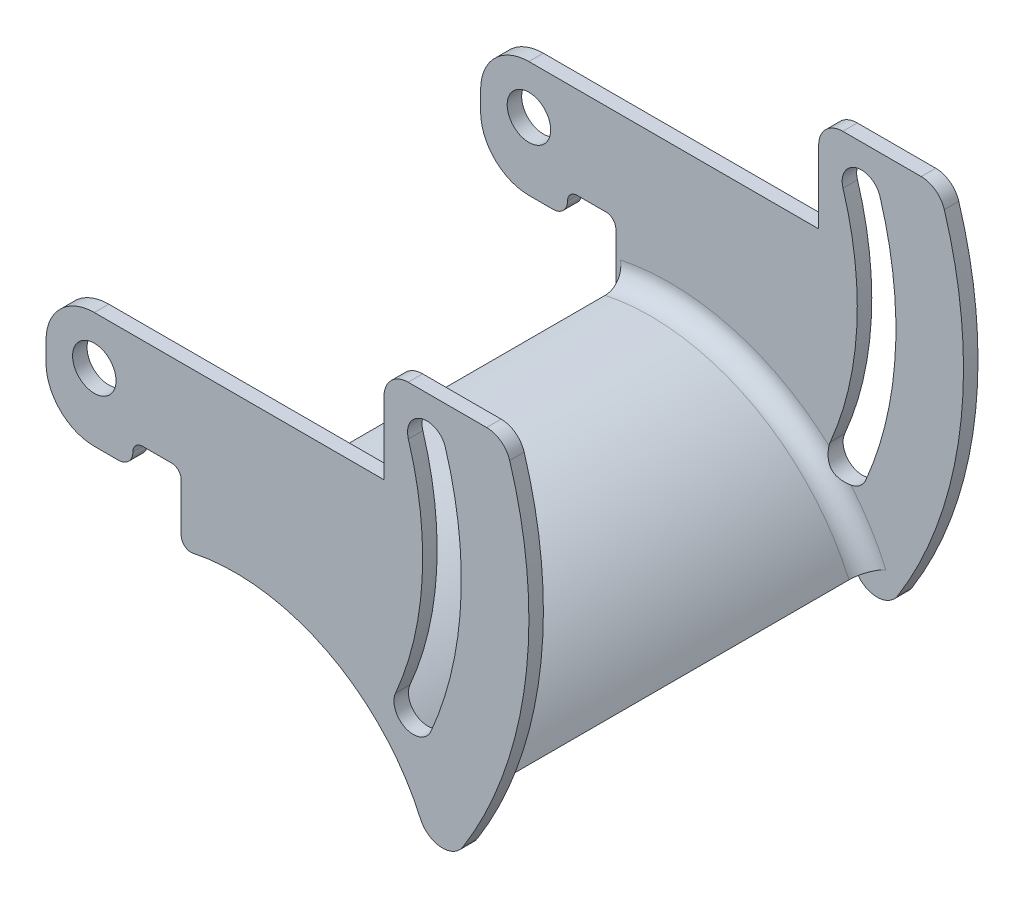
ISO-10303-21;
HEADER;
FILE_DESCRIPTION(('STEP AP214'),'2;1');
FILE_NAME('part.step','',(''),(''),'','','');
FILE_SCHEMA(('AUTOMOTIVE_DESIGN { 1 0 10303 214 1 1 1 1 }'));
ENDSEC;
DATA;
#1=APPLICATION_CONTEXT('core data for automotive mechanical design processes');
#2=APPLICATION_PROTOCOL_DEFINITION('international standard','automotive_design',2000,#1);
#3=PRODUCT_CONTEXT('',#1,'mechanical');
#4=PRODUCT('Part','Part','',(#3));
#5=PRODUCT_RELATED_PRODUCT_CATEGORY('part','',(#4));
#6=PRODUCT_DEFINITION_FORMATION('','',#4);
#7=PRODUCT_DEFINITION_CONTEXT('part definition',#1,'design');
#8=PRODUCT_DEFINITION('design','',#6,#7);
#9=PRODUCT_DEFINITION_SHAPE('','',#8);
#10=(LENGTH_UNIT() NAMED_UNIT(*) SI_UNIT(.MILLI.,.METRE.));
#11=(NAMED_UNIT(*) PLANE_ANGLE_UNIT() SI_UNIT($,.RADIAN.));
#12=(NAMED_UNIT(*) SI_UNIT($,.STERADIAN.) SOLID_ANGLE_UNIT());
#13=UNCERTAINTY_MEASURE_WITH_UNIT(LENGTH_MEASURE(1.E-05),#10,'distance_accuracy_value','');
#14=(GEOMETRIC_REPRESENTATION_CONTEXT(3) GLOBAL_UNCERTAINTY_ASSIGNED_CONTEXT((#13)) GLOBAL_UNIT_ASSIGNED_CONTEXT((#10,
#11,#12)) REPRESENTATION_CONTEXT('',''));
#15=CARTESIAN_POINT('',(0.,0.,0.));
#16=DIRECTION('',(0.,0.,1.));
#17=DIRECTION('',(1.,0.,0.));
#18=AXIS2_PLACEMENT_3D('',#15,#16,#17);
#19=CARTESIAN_POINT('',(-55.7123995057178,-94.0401304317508,7.00000000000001));
#20=DIRECTION('',(0.,0.,1.));
#21=DIRECTION('',(1.,0.,0.));
#22=AXIS2_PLACEMENT_3D('',#19,#20,#21);
#23=TOROIDAL_SURFACE('',#22,49.,4.);
#24=CARTESIAN_POINT('',(-22.7099331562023,-57.8208370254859,3.));
#25=CARTESIAN_POINT('',(-22.7320868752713,-57.9262736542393,2.99998607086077));
#26=CARTESIAN_POINT('',(-22.7499284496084,-58.0325440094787,3.00323212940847));
#27=CARTESIAN_POINT('',(-22.7769635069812,-58.2457428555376,3.01515067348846));
#28=CARTESIAN_POINT('',(-22.7861685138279,-58.3526702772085,3.0238159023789));
#29=CARTESIAN_POINT('',(-22.7959411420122,-58.5659211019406,3.04543035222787));
#30=CARTESIAN_POINT('',(-22.7965521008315,-58.6722448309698,3.05835774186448));
#31=CARTESIAN_POINT('',(-22.7893652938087,-58.8841765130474,3.08738972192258));
#32=CARTESIAN_POINT('',(-22.7815647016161,-58.9897842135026,3.10349537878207));
#33=CARTESIAN_POINT('',(-22.745853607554,-59.303655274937,3.15474074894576));
#34=CARTESIAN_POINT('',(-22.7056832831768,-59.5101242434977,3.19294899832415));
#35=CARTESIAN_POINT('',(-22.5934019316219,-59.9147168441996,3.26879456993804));
#36=CARTESIAN_POINT('',(-22.5212334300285,-60.1128247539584,3.30643073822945));
#37=CARTESIAN_POINT('',(-22.386103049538,-60.4086643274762,3.35741537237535));
#38=CARTESIAN_POINT('',(-22.3340065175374,-60.5108926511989,3.3740029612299));
#39=CARTESIAN_POINT('',(-22.2209266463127,-60.7109419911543,3.40327901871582));
#40=CARTESIAN_POINT('',(-22.159943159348,-60.8087629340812,3.41596742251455));
#41=CARTESIAN_POINT('',(-22.0296032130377,-60.9989394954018,3.43641543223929));
#42=CARTESIAN_POINT('',(-21.9602627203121,-61.0913050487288,3.44418426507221));
#43=CARTESIAN_POINT('',(-21.8136856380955,-61.2698602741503,3.45418266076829));
#44=CARTESIAN_POINT('',(-21.7364502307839,-61.3560508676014,3.45641305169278));
#45=CARTESIAN_POINT('',(-21.5837771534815,-61.5122358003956,3.45521975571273));
#46=CARTESIAN_POINT('',(-21.5090858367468,-61.5829670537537,3.45239426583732));
#47=CARTESIAN_POINT('',(-21.3546506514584,-61.7183326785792,3.44241362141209));
#48=CARTESIAN_POINT('',(-21.2749070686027,-61.782967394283,3.43525871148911));
#49=CARTESIAN_POINT('',(-21.1109289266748,-61.9057658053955,3.41708140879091));
#50=CARTESIAN_POINT('',(-21.0266916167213,-61.9639254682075,3.40605662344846));
#51=CARTESIAN_POINT('',(-20.8543410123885,-62.0734458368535,3.38083247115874));
#52=CARTESIAN_POINT('',(-20.7662260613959,-62.1248035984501,3.36663173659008));
#53=CARTESIAN_POINT('',(-20.4985529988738,-62.2674418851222,3.32078584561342));
#54=CARTESIAN_POINT('',(-20.3140375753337,-62.3484992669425,3.2856875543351));
#55=CARTESIAN_POINT('',(-19.9351187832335,-62.4820321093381,3.21355008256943));
#56=CARTESIAN_POINT('',(-19.7407049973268,-62.5344767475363,3.17650885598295));
#57=CARTESIAN_POINT('',(-19.4310009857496,-62.5934163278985,3.12304657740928));
#58=CARTESIAN_POINT('',(-19.3178972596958,-62.6099746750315,3.10464137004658));
#59=CARTESIAN_POINT('',(-19.090227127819,-62.6333616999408,3.07111372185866));
#60=CARTESIAN_POINT('',(-18.9756614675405,-62.6401951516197,3.0559896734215));
#61=CARTESIAN_POINT('',(-18.746158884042,-62.6439535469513,3.03046329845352));
#62=CARTESIAN_POINT('',(-18.6312239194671,-62.6409063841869,3.02004777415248));
#63=CARTESIAN_POINT('',(-18.4016666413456,-62.6248621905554,3.00524546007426));
#64=CARTESIAN_POINT('',(-18.2870442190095,-62.6118692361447,3.0008562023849));
#65=CARTESIAN_POINT('',(-18.0899209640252,-62.58083769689,2.99956939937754));
#66=CARTESIAN_POINT('',(-18.0070629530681,-62.5650922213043,3.00097604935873));
#67=CARTESIAN_POINT('',(-17.8426992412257,-62.5284487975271,3.00812394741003));
#68=CARTESIAN_POINT('',(-17.7611931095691,-62.5075525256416,3.01386378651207));
#69=CARTESIAN_POINT('',(-17.599507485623,-62.4606371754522,3.03011041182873));
#70=CARTESIAN_POINT('',(-17.519341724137,-62.4345823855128,3.04065113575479));
#71=CARTESIAN_POINT('',(-17.3614662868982,-62.3777606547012,3.06677961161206));
#72=CARTESIAN_POINT('',(-17.2837587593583,-62.3469897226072,3.08237165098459));
#73=CARTESIAN_POINT('',(-17.2076110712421,-62.3140404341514,3.1006158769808));
#74=B_SPLINE_CURVE_WITH_KNOTS('',3,(#24,#25,#26,#27,#28,#29,#30,#31,#32,#33,#34,#35,#36,#37,#38,
#39,#40,#41,#42,#43,#44,#45,#46,#47,#48,#49,#50,#51,#52,#53,#54,#55,#56,#57,#58,#59,#60,#61,#62,
#63,#64,#65,#66,#67,#68,#69,#70,#71,#72,#73),.UNSPECIFIED.,.F.,.F.,(4,2,2,2,2,2,2,2,2,2,2,2,2,2,
2,2,2,2,2,2,2,2,2,2,4),(0.,0.3229759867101,0.645520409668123,0.966437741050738,1.28746293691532,
1.9260537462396,2.56579625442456,2.91317131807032,3.26055215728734,3.60727952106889,
3.95395504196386,4.26227891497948,4.57058536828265,4.87908277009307,5.18771327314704,
5.79892082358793,6.41078548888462,6.75773637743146,7.10451689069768,7.4503192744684,
7.79598000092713,8.04878292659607,8.30150368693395,8.55603935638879,8.81079163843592),.UNSPECIFIED.);
#75=CARTESIAN_POINT('',(-22.7099331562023,-57.8208370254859,3.));
#76=VERTEX_POINT('',#75);
#77=CARTESIAN_POINT('',(-18.1386608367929,-62.5883552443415,3.));
#78=VERTEX_POINT('',#77);
#79=EDGE_CURVE('E707',#76,#78,#74,.T.);
#80=ORIENTED_EDGE('',*,*,#79,.F.);
#81=CARTESIAN_POINT('',(-55.7123995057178,-94.0401304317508,3.));
#82=DIRECTION('',(0.,0.,1.));
#83=DIRECTION('',(1.,0.,0.));
#84=AXIS2_PLACEMENT_3D('',#81,#82,#83);
#85=CIRCLE('',#84,49.);
#86=CARTESIAN_POINT('',(-65.8914971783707,-46.109076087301,3.));
#87=VERTEX_POINT('',#86);
#88=EDGE_CURVE('E702',#87,#76,#85,.F.);
#89=ORIENTED_EDGE('',*,*,#88,.F.);
#90=CARTESIAN_POINT('',(-65.8914971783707,-46.109076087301,7.00000000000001));
#91=DIRECTION('',(-0.97818478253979,-0.207736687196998,0.));
#92=DIRECTION('',(0.207736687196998,-0.97818478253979,0.));
#93=AXIS2_PLACEMENT_3D('',#90,#91,#92);
#94=CIRCLE('',#93,4.);
#95=CARTESIAN_POINT('',(-65.0605504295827,-50.0218152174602,7.00000000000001));
#96=VERTEX_POINT('',#95);
#97=EDGE_CURVE('E11',#87,#96,#94,.T.);
#98=ORIENTED_EDGE('',*,*,#97,.T.);
#99=CARTESIAN_POINT('',(-55.7123995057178,-94.0401304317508,7.00000000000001));
#100=DIRECTION('',(0.,0.,1.));
#101=DIRECTION('',(1.,0.,0.));
#102=AXIS2_PLACEMENT_3D('',#99,#100,#101);
#103=CIRCLE('',#102,45.);
#104=CARTESIAN_POINT('',(-14.5703248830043,-75.8102183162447,7.00000000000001));
#105=VERTEX_POINT('',#104);
#106=EDGE_CURVE('E699',#105,#96,#103,.T.);
#107=ORIENTED_EDGE('',*,*,#106,.F.);
#108=CARTESIAN_POINT('',(-10.9132515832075,-74.1897816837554,7.00000000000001));
#109=DIRECTION('',(0.405109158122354,-0.91426832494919,0.));
#110=DIRECTION('',(0.91426832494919,0.405109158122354,0.));
#111=AXIS2_PLACEMENT_3D('',#108,#109,#110);
#112=CIRCLE('',#111,4.);
#113=CARTESIAN_POINT('',(-10.9132515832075,-74.1897816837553,3.));
#114=VERTEX_POINT('',#113);
#115=EDGE_CURVE('E42',#105,#114,#112,.T.);
#116=ORIENTED_EDGE('',*,*,#115,.T.);
#117=CARTESIAN_POINT('',(-55.7123995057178,-94.0401304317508,3.));
#118=DIRECTION('',(0.,0.,1.));
#119=DIRECTION('',(1.,0.,0.));
#120=AXIS2_PLACEMENT_3D('',#117,#118,#119);
#121=CIRCLE('',#120,49.);
#122=EDGE_CURVE('E704',#78,#114,#121,.F.);
#123=ORIENTED_EDGE('',*,*,#122,.F.);
#124=EDGE_LOOP('',(#80,#89,#98,#107,#116,#123));
#125=FACE_BOUND('',#124,.T.);
#126=ADVANCED_FACE('F34',(#125),#23,.F.);
#127=CARTESIAN_POINT('',(-84.8528137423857,-30.,3.));
#128=DIRECTION('',(0.,0.,1.));
#129=DIRECTION('',(1.,0.,0.));
#130=AXIS2_PLACEMENT_3D('',#127,#128,#129);
#131=PLANE('',#130);
#132=CARTESIAN_POINT('',(-84.8528137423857,-30.,3.));
#133=DIRECTION('',(0.,0.,1.));
#134=DIRECTION('',(1.,0.,0.));
#135=AXIS2_PLACEMENT_3D('',#132,#133,#134);
#136=CIRCLE('',#135,4.5);
#137=CARTESIAN_POINT('',(-80.3528137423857,-30.,3.));
#138=VERTEX_POINT('',#137);
#139=EDGE_CURVE('E568',#138,#138,#136,.T.);
#140=ORIENTED_EDGE('',*,*,#139,.F.);
#141=EDGE_LOOP('',(#140));
#142=FACE_BOUND('',#141,.T.);
#143=CARTESIAN_POINT('',(-18.7952576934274,-58.6426131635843,3.));
#144=DIRECTION('',(0.,0.,1.));
#145=DIRECTION('',(1.,0.,0.));
#146=AXIS2_PLACEMENT_3D('',#143,#144,#145);
#147=CIRCLE('',#146,4.);
#148=CARTESIAN_POINT('',(-15.1253934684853,-60.2338694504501,3.));
#149=VERTEX_POINT('',#148);
#150=EDGE_CURVE('E541',#78,#149,#147,.T.);
#151=ORIENTED_EDGE('',*,*,#150,.F.);
#152=ORIENTED_EDGE('',*,*,#122,.T.);
#153=DIRECTION('',(-0.91426832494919,-0.405109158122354,0.));
#154=VECTOR('',#153,1.);
#155=CARTESIAN_POINT('',(-14.5703248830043,-75.8102183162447,3.));
#156=LINE('',#155,#154);
#157=CARTESIAN_POINT('',(-17.3131298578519,-77.0255457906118,3.));
#158=VERTEX_POINT('',#157);
#159=EDGE_CURVE('E49',#114,#158,#156,.T.);
#160=ORIENTED_EDGE('',*,*,#159,.T.);
#161=CARTESIAN_POINT('',(-12.7417882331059,-75.,3.));
#162=DIRECTION('',(0.,0.,1.));
#163=DIRECTION('',(-1.,0.,0.));
#164=AXIS2_PLACEMENT_3D('',#161,#162,#163);
#165=CIRCLE('',#164,5.);
#166=CARTESIAN_POINT('',(-8.4999632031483,-77.6470588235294,3.));
#167=VERTEX_POINT('',#166);
#168=EDGE_CURVE('E596',#158,#167,#165,.T.);
#169=ORIENTED_EDGE('',*,*,#168,.T.);
#170=CARTESIAN_POINT('',(-84.8528137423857,-30.,3.));
#171=DIRECTION('',(0.,0.,1.));
#172=DIRECTION('',(1.,0.,0.));
#173=AXIS2_PLACEMENT_3D('',#170,#171,#172);
#174=CIRCLE('',#173,90.);
#175=CARTESIAN_POINT('',(1.16641642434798,-3.52941176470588,3.));
#176=VERTEX_POINT('',#175);
#177=EDGE_CURVE('E598',#167,#176,#174,.T.);
#178=ORIENTED_EDGE('',*,*,#177,.T.);
#179=CARTESIAN_POINT('',(-3.61242969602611,-5.,3.));
#180=DIRECTION('',(0.,0.,1.));
#181=DIRECTION('',(-1.,0.,0.));
#182=AXIS2_PLACEMENT_3D('',#179,#180,#181);
#183=CIRCLE('',#182,5.);
#184=CARTESIAN_POINT('',(-3.61242969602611,0.,3.));
#185=VERTEX_POINT('',#184);
#186=EDGE_CURVE('E600',#176,#185,#183,.T.);
#187=ORIENTED_EDGE('',*,*,#186,.T.);
#188=DIRECTION('',(-1.,0.,0.));
#189=VECTOR('',#188,1.);
#190=CARTESIAN_POINT('',(-19.8528137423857,0.,3.));
#191=LINE('',#190,#189);
#192=CARTESIAN_POINT('',(-19.8528137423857,0.,3.));
#193=VERTEX_POINT('',#192);
#194=EDGE_CURVE('E602',#185,#193,#191,.T.);
#195=ORIENTED_EDGE('',*,*,#194,.T.);
#196=CARTESIAN_POINT('',(-19.8528137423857,-5.,3.));
#197=DIRECTION('',(0.,0.,1.));
#198=DIRECTION('',(-1.,0.,0.));
#199=AXIS2_PLACEMENT_3D('',#196,#197,#198);
#200=CIRCLE('',#199,5.);
#201=CARTESIAN_POINT('',(-24.8528137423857,-5.,3.));
#202=VERTEX_POINT('',#201);
#203=EDGE_CURVE('E604',#193,#202,#200,.T.);
#204=ORIENTED_EDGE('',*,*,#203,.T.);
#205=DIRECTION('',(0.,-1.,0.));
#206=VECTOR('',#205,1.);
#207=CARTESIAN_POINT('',(-24.8528137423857,-20.,3.));
#208=LINE('',#207,#206);
#209=CARTESIAN_POINT('',(-24.8528137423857,-20.,3.));
#210=VERTEX_POINT('',#209);
#211=EDGE_CURVE('E606',#202,#210,#208,.T.);
#212=ORIENTED_EDGE('',*,*,#211,.T.);
#213=DIRECTION('',(-1.,0.,0.));
#214=VECTOR('',#213,1.);
#215=CARTESIAN_POINT('',(-24.8528137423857,-20.,3.));
#216=LINE('',#215,#214);
#217=CARTESIAN_POINT('',(-84.8528137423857,-20.,3.));
#218=VERTEX_POINT('',#217);
#219=EDGE_CURVE('E608',#210,#218,#216,.T.);
#220=ORIENTED_EDGE('',*,*,#219,.T.);
#221=CARTESIAN_POINT('',(-84.8528137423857,-30.,3.));
#222=DIRECTION('',(0.,0.,1.));
#223=DIRECTION('',(1.,0.,0.));
#224=AXIS2_PLACEMENT_3D('',#221,#222,#223);
#225=CIRCLE('',#224,10.);
#226=CARTESIAN_POINT('',(-94.8528137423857,-30.,3.));
#227=VERTEX_POINT('',#226);
#228=EDGE_CURVE('E574',#218,#227,#225,.T.);
#229=ORIENTED_EDGE('',*,*,#228,.T.);
#230=DIRECTION('',(0.,-1.,0.));
#231=VECTOR('',#230,1.);
#232=CARTESIAN_POINT('',(-94.8528137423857,-30.,3.));
#233=LINE('',#232,#231);
#234=CARTESIAN_POINT('',(-94.8528137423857,-33.9999999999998,3.));
#235=VERTEX_POINT('',#234);
#236=EDGE_CURVE('E577',#227,#235,#233,.T.);
#237=ORIENTED_EDGE('',*,*,#236,.T.);
#238=CARTESIAN_POINT('',(-84.8528137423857,-33.9999999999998,3.));
#239=DIRECTION('',(0.,0.,1.));
#240=DIRECTION('',(-1.,0.,0.));
#241=AXIS2_PLACEMENT_3D('',#238,#239,#240);
#242=CIRCLE('',#241,9.99999999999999);
#243=CARTESIAN_POINT('',(-84.8528137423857,-43.9999999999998,3.));
#244=VERTEX_POINT('',#243);
#245=EDGE_CURVE('E580',#235,#244,#242,.T.);
#246=ORIENTED_EDGE('',*,*,#245,.T.);
#247=DIRECTION('',(1.,0.,0.));
#248=VECTOR('',#247,1.);
#249=CARTESIAN_POINT('',(-84.8528137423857,-43.9999999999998,3.));
#250=LINE('',#249,#248);
#251=CARTESIAN_POINT('',(-79.8528137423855,-43.9999999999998,3.));
#252=VERTEX_POINT('',#251);
#253=EDGE_CURVE('E582',#244,#252,#250,.T.);
#254=ORIENTED_EDGE('',*,*,#253,.T.);
#255=CARTESIAN_POINT('',(-79.8528137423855,-41.,3.));
#256=DIRECTION('',(0.,0.,1.));
#257=DIRECTION('',(1.,0.,0.));
#258=AXIS2_PLACEMENT_3D('',#255,#256,#257);
#259=CIRCLE('',#258,2.99999999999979);
#260=CARTESIAN_POINT('',(-76.8528137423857,-41.,3.));
#261=VERTEX_POINT('',#260);
#262=EDGE_CURVE('E584',#252,#261,#259,.T.);
#263=ORIENTED_EDGE('',*,*,#262,.T.);
#264=CARTESIAN_POINT('',(-74.8528137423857,-41.,3.));
#265=DIRECTION('',(0.,0.,-1.));
#266=DIRECTION('',(1.,0.,0.));
#267=AXIS2_PLACEMENT_3D('',#264,#265,#266);
#268=CIRCLE('',#267,2.00000000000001);
#269=CARTESIAN_POINT('',(-74.8528137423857,-39.,3.));
#270=VERTEX_POINT('',#269);
#271=EDGE_CURVE('E586',#261,#270,#268,.T.);
#272=ORIENTED_EDGE('',*,*,#271,.T.);
#273=DIRECTION('',(1.,0.,0.));
#274=VECTOR('',#273,1.);
#275=CARTESIAN_POINT('',(-74.8528137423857,-39.,3.));
#276=LINE('',#275,#274);
#277=CARTESIAN_POINT('',(-68.8528137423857,-39.,3.));
#278=VERTEX_POINT('',#277);
#279=EDGE_CURVE('E588',#270,#278,#276,.T.);
#280=ORIENTED_EDGE('',*,*,#279,.T.);
#281=CARTESIAN_POINT('',(-68.8528137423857,-41.,3.));
#282=DIRECTION('',(0.,0.,-1.));
#283=DIRECTION('',(-1.,0.,0.));
#284=AXIS2_PLACEMENT_3D('',#281,#282,#283);
#285=CIRCLE('',#284,2.);
#286=CARTESIAN_POINT('',(-66.8528137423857,-41.,3.));
#287=VERTEX_POINT('',#286);
#288=EDGE_CURVE('E590',#278,#287,#285,.T.);
#289=ORIENTED_EDGE('',*,*,#288,.T.);
#290=DIRECTION('',(0.,-1.,0.));
#291=VECTOR('',#290,1.);
#292=CARTESIAN_POINT('',(-66.8528137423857,-41.,3.));
#293=LINE('',#292,#291);
#294=CARTESIAN_POINT('',(-66.8528137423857,-51.,3.));
#295=VERTEX_POINT('',#294);
#296=EDGE_CURVE('E592',#287,#295,#293,.T.);
#297=ORIENTED_EDGE('',*,*,#296,.T.);
#298=CARTESIAN_POINT('',(-64.8528137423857,-51.,3.));
#299=DIRECTION('',(0.,0.,1.));
#300=DIRECTION('',(1.,0.,0.));
#301=AXIS2_PLACEMENT_3D('',#298,#299,#300);
#302=CIRCLE('',#301,1.99999999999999);
#303=CARTESIAN_POINT('',(-64.4373403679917,-52.9563695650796,3.));
#304=VERTEX_POINT('',#303);
#305=EDGE_CURVE('E594',#295,#304,#302,.T.);
#306=ORIENTED_EDGE('',*,*,#305,.T.);
#307=DIRECTION('',(-0.207736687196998,0.97818478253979,0.));
#308=VECTOR('',#307,1.);
#309=CARTESIAN_POINT('',(-64.4373403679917,-52.9563695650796,3.));
#310=LINE('',#309,#308);
#311=EDGE_CURVE('E57',#304,#87,#310,.T.);
#312=ORIENTED_EDGE('',*,*,#311,.T.);
#313=ORIENTED_EDGE('',*,*,#88,.T.);
#314=CARTESIAN_POINT('',(-22.4651219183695,-57.0513568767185,3.));
#315=VERTEX_POINT('',#314);
#316=EDGE_CURVE('E542',#315,#76,#147,.T.);
#317=ORIENTED_EDGE('',*,*,#316,.F.);
#318=CARTESIAN_POINT('',(-84.8528137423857,-30.,3.));
#319=DIRECTION('',(0.,0.,-1.));
#320=DIRECTION('',(1.,0.,0.));
#321=AXIS2_PLACEMENT_3D('',#318,#319,#320);
#322=CIRCLE('',#321,68.);
#323=CARTESIAN_POINT('',(-19.8094521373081,-10.1666666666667,3.));
#324=VERTEX_POINT('',#323);
#325=EDGE_CURVE('E538',#324,#315,#322,.T.);
#326=ORIENTED_EDGE('',*,*,#325,.F.);
#327=CARTESIAN_POINT('',(-15.9833720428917,-9.00000000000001,3.));
#328=DIRECTION('',(0.,0.,1.));
#329=DIRECTION('',(1.,0.,0.));
#330=AXIS2_PLACEMENT_3D('',#327,#328,#329);
#331=CIRCLE('',#330,4.);
#332=CARTESIAN_POINT('',(-12.1572919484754,-7.83333333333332,3.));
#333=VERTEX_POINT('',#332);
#334=EDGE_CURVE('E536',#333,#324,#331,.T.);
#335=ORIENTED_EDGE('',*,*,#334,.F.);
#336=CARTESIAN_POINT('',(-84.8528137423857,-30.,3.));
#337=DIRECTION('',(0.,0.,1.));
#338=DIRECTION('',(1.,0.,0.));
#339=AXIS2_PLACEMENT_3D('',#336,#337,#338);
#340=CIRCLE('',#339,76.);
#341=EDGE_CURVE('E545',#149,#333,#340,.T.);
#342=ORIENTED_EDGE('',*,*,#341,.F.);
#343=EDGE_LOOP('',(#151,#152,#160,#169,#178,#187,#195,#204,#212,#220,#229,#237,#246,#254,#263,
#272,#280,#289,#297,#306,#312,#313,#317,#326,#335,#342));
#344=FACE_BOUND('',#343,.T.);
#345=ADVANCED_FACE('F734',(#142,#344),#131,.T.);
#346=CARTESIAN_POINT('',(-84.8528137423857,-30.,0.));
#347=DIRECTION('',(0.,0.,1.));
#348=DIRECTION('',(1.,0.,0.));
#349=AXIS2_PLACEMENT_3D('',#346,#347,#348);
#350=PLANE('',#349);
#351=CARTESIAN_POINT('',(-84.8528137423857,-30.,0.));
#352=DIRECTION('',(0.,0.,1.));
#353=DIRECTION('',(1.,0.,0.));
#354=AXIS2_PLACEMENT_3D('',#351,#352,#353);
#355=CIRCLE('',#354,4.5);
#356=CARTESIAN_POINT('',(-80.3528137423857,-30.,0.));
#357=VERTEX_POINT('',#356);
#358=EDGE_CURVE('E567',#357,#357,#355,.T.);
#359=ORIENTED_EDGE('',*,*,#358,.T.);
#360=EDGE_LOOP('',(#359));
#361=FACE_BOUND('',#360,.T.);
#362=CARTESIAN_POINT('',(-84.8528137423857,-30.,0.));
#363=DIRECTION('',(0.,0.,1.));
#364=DIRECTION('',(1.,0.,0.));
#365=AXIS2_PLACEMENT_3D('',#362,#363,#364);
#366=CIRCLE('',#365,10.);
#367=CARTESIAN_POINT('',(-84.8528137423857,-20.,0.));
#368=VERTEX_POINT('',#367);
#369=CARTESIAN_POINT('',(-94.8528137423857,-30.,0.));
#370=VERTEX_POINT('',#369);
#371=EDGE_CURVE('E571',#368,#370,#366,.T.);
#372=ORIENTED_EDGE('',*,*,#371,.F.);
#373=DIRECTION('',(-1.,0.,0.));
#374=VECTOR('',#373,1.);
#375=CARTESIAN_POINT('',(-24.8528137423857,-20.,0.));
#376=LINE('',#375,#374);
#377=CARTESIAN_POINT('',(-24.8528137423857,-20.,0.));
#378=VERTEX_POINT('',#377);
#379=EDGE_CURVE('E578',#378,#368,#376,.T.);
#380=ORIENTED_EDGE('',*,*,#379,.F.);
#381=DIRECTION('',(0.,-1.,0.));
#382=VECTOR('',#381,1.);
#383=CARTESIAN_POINT('',(-24.8528137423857,-20.,0.));
#384=LINE('',#383,#382);
#385=CARTESIAN_POINT('',(-24.8528137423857,-5.,0.));
#386=VERTEX_POINT('',#385);
#387=EDGE_CURVE('E643',#386,#378,#384,.T.);
#388=ORIENTED_EDGE('',*,*,#387,.F.);
#389=CARTESIAN_POINT('',(-19.8528137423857,-5.,0.));
#390=DIRECTION('',(0.,0.,1.));
#391=DIRECTION('',(-1.,0.,0.));
#392=AXIS2_PLACEMENT_3D('',#389,#390,#391);
#393=CIRCLE('',#392,5.);
#394=CARTESIAN_POINT('',(-19.8528137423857,0.,0.));
#395=VERTEX_POINT('',#394);
#396=EDGE_CURVE('E641',#395,#386,#393,.T.);
#397=ORIENTED_EDGE('',*,*,#396,.F.);
#398=DIRECTION('',(-1.,0.,0.));
#399=VECTOR('',#398,1.);
#400=CARTESIAN_POINT('',(-19.8528137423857,0.,0.));
#401=LINE('',#400,#399);
#402=CARTESIAN_POINT('',(-3.61242969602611,0.,0.));
#403=VERTEX_POINT('',#402);
#404=EDGE_CURVE('E639',#403,#395,#401,.T.);
#405=ORIENTED_EDGE('',*,*,#404,.F.);
#406=CARTESIAN_POINT('',(-3.61242969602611,-5.,0.));
#407=DIRECTION('',(0.,0.,1.));
#408=DIRECTION('',(-1.,0.,0.));
#409=AXIS2_PLACEMENT_3D('',#406,#407,#408);
#410=CIRCLE('',#409,5.);
#411=CARTESIAN_POINT('',(1.16641642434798,-3.52941176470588,0.));
#412=VERTEX_POINT('',#411);
#413=EDGE_CURVE('E637',#412,#403,#410,.T.);
#414=ORIENTED_EDGE('',*,*,#413,.F.);
#415=CARTESIAN_POINT('',(-84.8528137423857,-30.,0.));
#416=DIRECTION('',(0.,0.,1.));
#417=DIRECTION('',(1.,0.,0.));
#418=AXIS2_PLACEMENT_3D('',#415,#416,#417);
#419=CIRCLE('',#418,90.);
#420=CARTESIAN_POINT('',(-8.4999632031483,-77.6470588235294,0.));
#421=VERTEX_POINT('',#420);
#422=EDGE_CURVE('E635',#421,#412,#419,.T.);
#423=ORIENTED_EDGE('',*,*,#422,.F.);
#424=CARTESIAN_POINT('',(-12.7417882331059,-75.,0.));
#425=DIRECTION('',(0.,0.,1.));
#426=DIRECTION('',(-1.,0.,0.));
#427=AXIS2_PLACEMENT_3D('',#424,#425,#426);
#428=CIRCLE('',#427,5.);
#429=CARTESIAN_POINT('',(-17.3131298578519,-77.0255457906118,0.));
#430=VERTEX_POINT('',#429);
#431=EDGE_CURVE('E633',#430,#421,#428,.T.);
#432=ORIENTED_EDGE('',*,*,#431,.F.);
#433=CARTESIAN_POINT('',(-55.7123995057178,-94.0401304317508,0.));
#434=DIRECTION('',(0.,0.,-1.));
#435=DIRECTION('',(1.,0.,0.));
#436=AXIS2_PLACEMENT_3D('',#433,#434,#435);
#437=CIRCLE('',#436,42.);
#438=CARTESIAN_POINT('',(-64.4373403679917,-52.9563695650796,0.));
#439=VERTEX_POINT('',#438);
#440=EDGE_CURVE('E631',#439,#430,#437,.T.);
#441=ORIENTED_EDGE('',*,*,#440,.F.);
#442=CARTESIAN_POINT('',(-64.8528137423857,-51.,0.));
#443=DIRECTION('',(0.,0.,1.));
#444=DIRECTION('',(1.,0.,0.));
#445=AXIS2_PLACEMENT_3D('',#442,#443,#444);
#446=CIRCLE('',#445,1.99999999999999);
#447=CARTESIAN_POINT('',(-66.8528137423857,-51.,0.));
#448=VERTEX_POINT('',#447);
#449=EDGE_CURVE('E629',#448,#439,#446,.T.);
#450=ORIENTED_EDGE('',*,*,#449,.F.);
#451=DIRECTION('',(0.,-1.,0.));
#452=VECTOR('',#451,1.);
#453=CARTESIAN_POINT('',(-66.8528137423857,-41.,0.));
#454=LINE('',#453,#452);
#455=CARTESIAN_POINT('',(-66.8528137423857,-41.,0.));
#456=VERTEX_POINT('',#455);
#457=EDGE_CURVE('E627',#456,#448,#454,.T.);
#458=ORIENTED_EDGE('',*,*,#457,.F.);
#459=CARTESIAN_POINT('',(-68.8528137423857,-41.,0.));
#460=DIRECTION('',(0.,0.,-1.));
#461=DIRECTION('',(-1.,0.,0.));
#462=AXIS2_PLACEMENT_3D('',#459,#460,#461);
#463=CIRCLE('',#462,2.);
#464=CARTESIAN_POINT('',(-68.8528137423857,-39.,0.));
#465=VERTEX_POINT('',#464);
#466=EDGE_CURVE('E625',#465,#456,#463,.T.);
#467=ORIENTED_EDGE('',*,*,#466,.F.);
#468=DIRECTION('',(1.,0.,0.));
#469=VECTOR('',#468,1.);
#470=CARTESIAN_POINT('',(-74.8528137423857,-39.,0.));
#471=LINE('',#470,#469);
#472=CARTESIAN_POINT('',(-74.8528137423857,-39.,0.));
#473=VERTEX_POINT('',#472);
#474=EDGE_CURVE('E623',#473,#465,#471,.T.);
#475=ORIENTED_EDGE('',*,*,#474,.F.);
#476=CARTESIAN_POINT('',(-74.8528137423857,-41.,0.));
#477=DIRECTION('',(0.,0.,-1.));
#478=DIRECTION('',(1.,0.,0.));
#479=AXIS2_PLACEMENT_3D('',#476,#477,#478);
#480=CIRCLE('',#479,2.00000000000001);
#481=CARTESIAN_POINT('',(-76.8528137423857,-41.,0.));
#482=VERTEX_POINT('',#481);
#483=EDGE_CURVE('E621',#482,#473,#480,.T.);
#484=ORIENTED_EDGE('',*,*,#483,.F.);
#485=CARTESIAN_POINT('',(-79.8528137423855,-41.,0.));
#486=DIRECTION('',(0.,0.,1.));
#487=DIRECTION('',(1.,0.,0.));
#488=AXIS2_PLACEMENT_3D('',#485,#486,#487);
#489=CIRCLE('',#488,2.99999999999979);
#490=CARTESIAN_POINT('',(-79.8528137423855,-43.9999999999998,0.));
#491=VERTEX_POINT('',#490);
#492=EDGE_CURVE('E619',#491,#482,#489,.T.);
#493=ORIENTED_EDGE('',*,*,#492,.F.);
#494=DIRECTION('',(1.,0.,0.));
#495=VECTOR('',#494,1.);
#496=CARTESIAN_POINT('',(-84.8528137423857,-43.9999999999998,0.));
#497=LINE('',#496,#495);
#498=CARTESIAN_POINT('',(-84.8528137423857,-43.9999999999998,0.));
#499=VERTEX_POINT('',#498);
#500=EDGE_CURVE('E617',#499,#491,#497,.T.);
#501=ORIENTED_EDGE('',*,*,#500,.F.);
#502=CARTESIAN_POINT('',(-84.8528137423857,-33.9999999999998,0.));
#503=DIRECTION('',(0.,0.,1.));
#504=DIRECTION('',(-1.,0.,0.));
#505=AXIS2_PLACEMENT_3D('',#502,#503,#504);
#506=CIRCLE('',#505,9.99999999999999);
#507=CARTESIAN_POINT('',(-94.8528137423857,-33.9999999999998,0.));
#508=VERTEX_POINT('',#507);
#509=EDGE_CURVE('E615',#508,#499,#506,.T.);
#510=ORIENTED_EDGE('',*,*,#509,.F.);
#511=DIRECTION('',(0.,-1.,0.));
#512=VECTOR('',#511,1.);
#513=CARTESIAN_POINT('',(-94.8528137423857,-30.,0.));
#514=LINE('',#513,#512);
#515=EDGE_CURVE('E613',#370,#508,#514,.T.);
#516=ORIENTED_EDGE('',*,*,#515,.F.);
#517=EDGE_LOOP('',(#372,#380,#388,#397,#405,#414,#423,#432,#441,#450,#458,#467,#475,#484,#493,
#501,#510,#516));
#518=FACE_BOUND('',#517,.T.);
#519=CARTESIAN_POINT('',(-15.9833720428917,-9.00000000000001,0.));
#520=DIRECTION('',(0.,0.,1.));
#521=DIRECTION('',(1.,0.,0.));
#522=AXIS2_PLACEMENT_3D('',#519,#520,#521);
#523=CIRCLE('',#522,4.);
#524=CARTESIAN_POINT('',(-12.1572919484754,-7.83333333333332,0.));
#525=VERTEX_POINT('',#524);
#526=CARTESIAN_POINT('',(-19.8094521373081,-10.1666666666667,0.));
#527=VERTEX_POINT('',#526);
#528=EDGE_CURVE('E535',#525,#527,#523,.T.);
#529=ORIENTED_EDGE('',*,*,#528,.T.);
#530=CARTESIAN_POINT('',(-84.8528137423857,-30.,0.));
#531=DIRECTION('',(0.,0.,-1.));
#532=DIRECTION('',(1.,0.,0.));
#533=AXIS2_PLACEMENT_3D('',#530,#531,#532);
#534=CIRCLE('',#533,68.);
#535=CARTESIAN_POINT('',(-22.4651219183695,-57.0513568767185,0.));
#536=VERTEX_POINT('',#535);
#537=EDGE_CURVE('E550',#527,#536,#534,.T.);
#538=ORIENTED_EDGE('',*,*,#537,.T.);
#539=CARTESIAN_POINT('',(-18.7952576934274,-58.6426131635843,0.));
#540=DIRECTION('',(0.,0.,1.));
#541=DIRECTION('',(1.,0.,0.));
#542=AXIS2_PLACEMENT_3D('',#539,#540,#541);
#543=CIRCLE('',#542,4.);
#544=CARTESIAN_POINT('',(-15.1253934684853,-60.2338694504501,0.));
#545=VERTEX_POINT('',#544);
#546=EDGE_CURVE('E553',#536,#545,#543,.T.);
#547=ORIENTED_EDGE('',*,*,#546,.T.);
#548=CARTESIAN_POINT('',(-84.8528137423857,-30.,0.));
#549=DIRECTION('',(0.,0.,1.));
#550=DIRECTION('',(1.,0.,0.));
#551=AXIS2_PLACEMENT_3D('',#548,#549,#550);
#552=CIRCLE('',#551,76.);
#553=EDGE_CURVE('E539',#545,#525,#552,.T.);
#554=ORIENTED_EDGE('',*,*,#553,.T.);
#555=EDGE_LOOP('',(#529,#538,#547,#554));
#556=FACE_BOUND('',#555,.T.);
#557=ADVANCED_FACE('F737',(#361,#518,#556),#350,.F.);
#558=CARTESIAN_POINT('',(-84.8528137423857,-30.,3.));
#559=DIRECTION('',(0.,0.,-1.));
#560=DIRECTION('',(-1.,0.,0.));
#561=AXIS2_PLACEMENT_3D('',#558,#559,#560);
#562=CYLINDRICAL_SURFACE('',#561,10.);
#563=ORIENTED_EDGE('',*,*,#371,.T.);
#564=DIRECTION('',(0.,0.,-1.));
#565=VECTOR('',#564,1.);
#566=CARTESIAN_POINT('',(-94.8528137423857,-30.,3.));
#567=LINE('',#566,#565);
#568=EDGE_CURVE('E696',#227,#370,#567,.T.);
#569=ORIENTED_EDGE('',*,*,#568,.F.);
#570=ORIENTED_EDGE('',*,*,#228,.F.);
#571=DIRECTION('',(0.,0.,-1.));
#572=VECTOR('',#571,1.);
#573=CARTESIAN_POINT('',(-84.8528137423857,-20.,3.));
#574=LINE('',#573,#572);
#575=EDGE_CURVE('E610',#218,#368,#574,.T.);
#576=ORIENTED_EDGE('',*,*,#575,.T.);
#577=EDGE_LOOP('',(#563,#569,#570,#576));
#578=FACE_BOUND('',#577,.T.);
#579=ADVANCED_FACE('F741',(#578),#562,.T.);
#580=CARTESIAN_POINT('',(-94.8528137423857,-30.,3.));
#581=DIRECTION('',(1.,0.,0.));
#582=DIRECTION('',(0.,1.,0.));
#583=AXIS2_PLACEMENT_3D('',#580,#581,#582);
#584=PLANE('',#583);
#585=ORIENTED_EDGE('',*,*,#515,.T.);
#586=DIRECTION('',(0.,0.,-1.));
#587=VECTOR('',#586,1.);
#588=CARTESIAN_POINT('',(-94.8528137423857,-33.9999999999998,3.));
#589=LINE('',#588,#587);
#590=EDGE_CURVE('E693',#235,#508,#589,.T.);
#591=ORIENTED_EDGE('',*,*,#590,.F.);
#592=ORIENTED_EDGE('',*,*,#236,.F.);
#593=ORIENTED_EDGE('',*,*,#568,.T.);
#594=EDGE_LOOP('',(#585,#591,#592,#593));
#595=FACE_BOUND('',#594,.T.);
#596=ADVANCED_FACE('F805',(#595),#584,.F.);
#597=CARTESIAN_POINT('',(-84.8528137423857,-33.9999999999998,3.));
#598=DIRECTION('',(0.,0.,-1.));
#599=DIRECTION('',(-1.,0.,0.));
#600=AXIS2_PLACEMENT_3D('',#597,#598,#599);
#601=CYLINDRICAL_SURFACE('',#600,9.99999999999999);
#602=ORIENTED_EDGE('',*,*,#509,.T.);
#603=DIRECTION('',(0.,0.,-1.));
#604=VECTOR('',#603,1.);
#605=CARTESIAN_POINT('',(-84.8528137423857,-43.9999999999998,3.));
#606=LINE('',#605,#604);
#607=EDGE_CURVE('E690',#244,#499,#606,.T.);
#608=ORIENTED_EDGE('',*,*,#607,.F.);
#609=ORIENTED_EDGE('',*,*,#245,.F.);
#610=ORIENTED_EDGE('',*,*,#590,.T.);
#611=EDGE_LOOP('',(#602,#608,#609,#610));
#612=FACE_BOUND('',#611,.T.);
#613=ADVANCED_FACE('F801',(#612),#601,.T.);
#614=CARTESIAN_POINT('',(-84.8528137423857,-43.9999999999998,3.));
#615=DIRECTION('',(0.,1.,0.));
#616=DIRECTION('',(-1.,0.,0.));
#617=AXIS2_PLACEMENT_3D('',#614,#615,#616);
#618=PLANE('',#617);
#619=ORIENTED_EDGE('',*,*,#500,.T.);
#620=DIRECTION('',(0.,0.,-1.));
#621=VECTOR('',#620,1.);
#622=CARTESIAN_POINT('',(-79.8528137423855,-43.9999999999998,3.));
#623=LINE('',#622,#621);
#624=EDGE_CURVE('E687',#252,#491,#623,.T.);
#625=ORIENTED_EDGE('',*,*,#624,.F.);
#626=ORIENTED_EDGE('',*,*,#253,.F.);
#627=ORIENTED_EDGE('',*,*,#607,.T.);
#628=EDGE_LOOP('',(#619,#625,#626,#627));
#629=FACE_BOUND('',#628,.T.);
#630=ADVANCED_FACE('F797',(#629),#618,.F.);
#631=CARTESIAN_POINT('',(-79.8528137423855,-41.,3.));
#632=DIRECTION('',(0.,0.,-1.));
#633=DIRECTION('',(-1.,0.,0.));
#634=AXIS2_PLACEMENT_3D('',#631,#632,#633);
#635=CYLINDRICAL_SURFACE('',#634,2.99999999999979);
#636=ORIENTED_EDGE('',*,*,#492,.T.);
#637=DIRECTION('',(0.,0.,-1.));
#638=VECTOR('',#637,1.);
#639=CARTESIAN_POINT('',(-76.8528137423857,-41.,3.));
#640=LINE('',#639,#638);
#641=EDGE_CURVE('E684',#261,#482,#640,.T.);
#642=ORIENTED_EDGE('',*,*,#641,.F.);
#643=ORIENTED_EDGE('',*,*,#262,.F.);
#644=ORIENTED_EDGE('',*,*,#624,.T.);
#645=EDGE_LOOP('',(#636,#642,#643,#644));
#646=FACE_BOUND('',#645,.T.);
#647=ADVANCED_FACE('F793',(#646),#635,.T.);
#648=CARTESIAN_POINT('',(-74.8528137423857,-41.,3.));
#649=DIRECTION('',(0.,0.,-1.));
#650=DIRECTION('',(-1.,0.,0.));
#651=AXIS2_PLACEMENT_3D('',#648,#649,#650);
#652=CYLINDRICAL_SURFACE('',#651,2.00000000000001);
#653=ORIENTED_EDGE('',*,*,#483,.T.);
#654=DIRECTION('',(0.,0.,-1.));
#655=VECTOR('',#654,1.);
#656=CARTESIAN_POINT('',(-74.8528137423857,-39.,3.));
#657=LINE('',#656,#655);
#658=EDGE_CURVE('E681',#270,#473,#657,.T.);
#659=ORIENTED_EDGE('',*,*,#658,.F.);
#660=ORIENTED_EDGE('',*,*,#271,.F.);
#661=ORIENTED_EDGE('',*,*,#641,.T.);
#662=EDGE_LOOP('',(#653,#659,#660,#661));
#663=FACE_BOUND('',#662,.T.);
#664=ADVANCED_FACE('F789',(#663),#652,.F.);
#665=CARTESIAN_POINT('',(-74.8528137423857,-39.,3.));
#666=DIRECTION('',(0.,1.,0.));
#667=DIRECTION('',(-1.,0.,0.));
#668=AXIS2_PLACEMENT_3D('',#665,#666,#667);
#669=PLANE('',#668);
#670=ORIENTED_EDGE('',*,*,#474,.T.);
#671=DIRECTION('',(0.,0.,-1.));
#672=VECTOR('',#671,1.);
#673=CARTESIAN_POINT('',(-68.8528137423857,-39.,3.));
#674=LINE('',#673,#672);
#675=EDGE_CURVE('E678',#278,#465,#674,.T.);
#676=ORIENTED_EDGE('',*,*,#675,.F.);
#677=ORIENTED_EDGE('',*,*,#279,.F.);
#678=ORIENTED_EDGE('',*,*,#658,.T.);
#679=EDGE_LOOP('',(#670,#676,#677,#678));
#680=FACE_BOUND('',#679,.T.);
#681=ADVANCED_FACE('F785',(#680),#669,.F.);
#682=CARTESIAN_POINT('',(-68.8528137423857,-41.,3.));
#683=DIRECTION('',(0.,0.,-1.));
#684=DIRECTION('',(-1.,0.,0.));
#685=AXIS2_PLACEMENT_3D('',#682,#683,#684);
#686=CYLINDRICAL_SURFACE('',#685,2.);
#687=ORIENTED_EDGE('',*,*,#466,.T.);
#688=DIRECTION('',(0.,0.,-1.));
#689=VECTOR('',#688,1.);
#690=CARTESIAN_POINT('',(-66.8528137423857,-41.,3.));
#691=LINE('',#690,#689);
#692=EDGE_CURVE('E675',#287,#456,#691,.T.);
#693=ORIENTED_EDGE('',*,*,#692,.F.);
#694=ORIENTED_EDGE('',*,*,#288,.F.);
#695=ORIENTED_EDGE('',*,*,#675,.T.);
#696=EDGE_LOOP('',(#687,#693,#694,#695));
#697=FACE_BOUND('',#696,.T.);
#698=ADVANCED_FACE('F781',(#697),#686,.F.);
#699=CARTESIAN_POINT('',(-66.8528137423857,-41.,3.));
#700=DIRECTION('',(1.,0.,0.));
#701=DIRECTION('',(0.,0.,-1.));
#702=AXIS2_PLACEMENT_3D('',#699,#700,#701);
#703=PLANE('',#702);
#704=ORIENTED_EDGE('',*,*,#457,.T.);
#705=DIRECTION('',(0.,0.,-1.));
#706=VECTOR('',#705,1.);
#707=CARTESIAN_POINT('',(-66.8528137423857,-51.,3.));
#708=LINE('',#707,#706);
#709=EDGE_CURVE('E672',#295,#448,#708,.T.);
#710=ORIENTED_EDGE('',*,*,#709,.F.);
#711=ORIENTED_EDGE('',*,*,#296,.F.);
#712=ORIENTED_EDGE('',*,*,#692,.T.);
#713=EDGE_LOOP('',(#704,#710,#711,#712));
#714=FACE_BOUND('',#713,.T.);
#715=ADVANCED_FACE('F777',(#714),#703,.F.);
#716=CARTESIAN_POINT('',(-64.8528137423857,-51.,3.));
#717=DIRECTION('',(0.,0.,-1.));
#718=DIRECTION('',(-1.,0.,0.));
#719=AXIS2_PLACEMENT_3D('',#716,#717,#718);
#720=CYLINDRICAL_SURFACE('',#719,1.99999999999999);
#721=ORIENTED_EDGE('',*,*,#449,.T.);
#722=DIRECTION('',(0.,0.,-1.));
#723=VECTOR('',#722,1.);
#724=CARTESIAN_POINT('',(-64.4373403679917,-52.9563695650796,3.));
#725=LINE('',#724,#723);
#726=EDGE_CURVE('E669',#304,#439,#725,.T.);
#727=ORIENTED_EDGE('',*,*,#726,.F.);
#728=ORIENTED_EDGE('',*,*,#305,.F.);
#729=ORIENTED_EDGE('',*,*,#709,.T.);
#730=EDGE_LOOP('',(#721,#727,#728,#729));
#731=FACE_BOUND('',#730,.T.);
#732=ADVANCED_FACE('F773',(#731),#720,.T.);
#733=CARTESIAN_POINT('',(-55.7123995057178,-94.0401304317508,3.));
#734=DIRECTION('',(0.,0.,-1.));
#735=DIRECTION('',(-1.,0.,0.));
#736=AXIS2_PLACEMENT_3D('',#733,#734,#735);
#737=CYLINDRICAL_SURFACE('',#736,42.);
#738=ORIENTED_EDGE('',*,*,#440,.T.);
#739=DIRECTION('',(0.,0.,-1.));
#740=VECTOR('',#739,1.);
#741=CARTESIAN_POINT('',(-17.3131298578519,-77.0255457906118,3.));
#742=LINE('',#741,#740);
#743=EDGE_CURVE('E666',#158,#430,#742,.T.);
#744=ORIENTED_EDGE('',*,*,#743,.F.);
#745=DIRECTION('',(0.,0.,-1.));
#746=VECTOR('',#745,1.);
#747=CARTESIAN_POINT('',(-17.3131298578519,-77.0255457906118,90.));
#748=LINE('',#747,#746);
#749=CARTESIAN_POINT('',(-17.3131298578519,-77.0255457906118,90.));
#750=VERTEX_POINT('',#749);
#751=EDGE_CURVE('E528',#750,#158,#748,.T.);
#752=ORIENTED_EDGE('',*,*,#751,.F.);
#753=DIRECTION('',(0.,0.,-1.));
#754=VECTOR('',#753,1.);
#755=CARTESIAN_POINT('',(-17.3131298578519,-77.0255457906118,93.));
#756=LINE('',#755,#754);
#757=CARTESIAN_POINT('',(-17.3131298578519,-77.0255457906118,93.));
#758=VERTEX_POINT('',#757);
#759=EDGE_CURVE('E482',#758,#750,#756,.T.);
#760=ORIENTED_EDGE('',*,*,#759,.F.);
#761=CARTESIAN_POINT('',(-55.7123995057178,-94.0401304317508,93.));
#762=DIRECTION('',(0.,0.,-1.));
#763=DIRECTION('',(1.,0.,0.));
#764=AXIS2_PLACEMENT_3D('',#761,#762,#763);
#765=CIRCLE('',#764,42.);
#766=CARTESIAN_POINT('',(-64.4373403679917,-52.9563695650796,93.));
#767=VERTEX_POINT('',#766);
#768=EDGE_CURVE('E411',#767,#758,#765,.T.);
#769=ORIENTED_EDGE('',*,*,#768,.F.);
#770=DIRECTION('',(0.,0.,-1.));
#771=VECTOR('',#770,1.);
#772=CARTESIAN_POINT('',(-64.4373403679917,-52.9563695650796,93.));
#773=LINE('',#772,#771);
#774=CARTESIAN_POINT('',(-64.4373403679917,-52.9563695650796,90.));
#775=VERTEX_POINT('',#774);
#776=EDGE_CURVE('E485',#767,#775,#773,.T.);
#777=ORIENTED_EDGE('',*,*,#776,.T.);
#778=DIRECTION('',(0.,0.,-1.));
#779=VECTOR('',#778,1.);
#780=CARTESIAN_POINT('',(-64.4373403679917,-52.9563695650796,90.));
#781=LINE('',#780,#779);
#782=EDGE_CURVE('E530',#775,#304,#781,.T.);
#783=ORIENTED_EDGE('',*,*,#782,.T.);
#784=ORIENTED_EDGE('',*,*,#726,.T.);
#785=EDGE_LOOP('',(#738,#744,#752,#760,#769,#777,#783,#784));
#786=FACE_BOUND('',#785,.T.);
#787=ADVANCED_FACE('F769',(#786),#737,.F.);
#788=CARTESIAN_POINT('',(-12.7417882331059,-75.,3.));
#789=DIRECTION('',(0.,0.,-1.));
#790=DIRECTION('',(-1.,0.,0.));
#791=AXIS2_PLACEMENT_3D('',#788,#789,#790);
#792=CYLINDRICAL_SURFACE('',#791,5.);
#793=ORIENTED_EDGE('',*,*,#431,.T.);
#794=DIRECTION('',(0.,0.,-1.));
#795=VECTOR('',#794,1.);
#796=CARTESIAN_POINT('',(-8.4999632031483,-77.6470588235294,3.));
#797=LINE('',#796,#795);
#798=EDGE_CURVE('E663',#167,#421,#797,.T.);
#799=ORIENTED_EDGE('',*,*,#798,.F.);
#800=ORIENTED_EDGE('',*,*,#168,.F.);
#801=ORIENTED_EDGE('',*,*,#743,.T.);
#802=EDGE_LOOP('',(#793,#799,#800,#801));
#803=FACE_BOUND('',#802,.T.);
#804=ADVANCED_FACE('F765',(#803),#792,.T.);
#805=CARTESIAN_POINT('',(-84.8528137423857,-30.,3.));
#806=DIRECTION('',(0.,0.,-1.));
#807=DIRECTION('',(-1.,0.,0.));
#808=AXIS2_PLACEMENT_3D('',#805,#806,#807);
#809=CYLINDRICAL_SURFACE('',#808,90.);
#810=ORIENTED_EDGE('',*,*,#422,.T.);
#811=DIRECTION('',(0.,0.,-1.));
#812=VECTOR('',#811,1.);
#813=CARTESIAN_POINT('',(1.16641642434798,-3.52941176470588,3.));
#814=LINE('',#813,#812);
#815=EDGE_CURVE('E660',#176,#412,#814,.T.);
#816=ORIENTED_EDGE('',*,*,#815,.F.);
#817=ORIENTED_EDGE('',*,*,#177,.F.);
#818=ORIENTED_EDGE('',*,*,#798,.T.);
#819=EDGE_LOOP('',(#810,#816,#817,#818));
#820=FACE_BOUND('',#819,.T.);
#821=ADVANCED_FACE('F761',(#820),#809,.T.);
#822=CARTESIAN_POINT('',(-3.61242969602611,-5.,3.));
#823=DIRECTION('',(0.,0.,-1.));
#824=DIRECTION('',(-1.,0.,0.));
#825=AXIS2_PLACEMENT_3D('',#822,#823,#824);
#826=CYLINDRICAL_SURFACE('',#825,5.);
#827=ORIENTED_EDGE('',*,*,#413,.T.);
#828=DIRECTION('',(0.,0.,-1.));
#829=VECTOR('',#828,1.);
#830=CARTESIAN_POINT('',(-3.61242969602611,0.,3.));
#831=LINE('',#830,#829);
#832=EDGE_CURVE('E657',#185,#403,#831,.T.);
#833=ORIENTED_EDGE('',*,*,#832,.F.);
#834=ORIENTED_EDGE('',*,*,#186,.F.);
#835=ORIENTED_EDGE('',*,*,#815,.T.);
#836=EDGE_LOOP('',(#827,#833,#834,#835));
#837=FACE_BOUND('',#836,.T.);
#838=ADVANCED_FACE('F757',(#837),#826,.T.);
#839=CARTESIAN_POINT('',(-19.8528137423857,0.,3.));
#840=DIRECTION('',(0.,-1.,0.));
#841=DIRECTION('',(0.,0.,-1.));
#842=AXIS2_PLACEMENT_3D('',#839,#840,#841);
#843=PLANE('',#842);
#844=ORIENTED_EDGE('',*,*,#404,.T.);
#845=DIRECTION('',(0.,0.,-1.));
#846=VECTOR('',#845,1.);
#847=CARTESIAN_POINT('',(-19.8528137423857,0.,3.));
#848=LINE('',#847,#846);
#849=EDGE_CURVE('E654',#193,#395,#848,.T.);
#850=ORIENTED_EDGE('',*,*,#849,.F.);
#851=ORIENTED_EDGE('',*,*,#194,.F.);
#852=ORIENTED_EDGE('',*,*,#832,.T.);
#853=EDGE_LOOP('',(#844,#850,#851,#852));
#854=FACE_BOUND('',#853,.T.);
#855=ADVANCED_FACE('F753',(#854),#843,.F.);
#856=CARTESIAN_POINT('',(-19.8528137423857,-5.,3.));
#857=DIRECTION('',(0.,0.,-1.));
#858=DIRECTION('',(-1.,0.,0.));
#859=AXIS2_PLACEMENT_3D('',#856,#857,#858);
#860=CYLINDRICAL_SURFACE('',#859,5.);
#861=ORIENTED_EDGE('',*,*,#396,.T.);
#862=DIRECTION('',(0.,0.,-1.));
#863=VECTOR('',#862,1.);
#864=CARTESIAN_POINT('',(-24.8528137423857,-5.,3.));
#865=LINE('',#864,#863);
#866=EDGE_CURVE('E651',#202,#386,#865,.T.);
#867=ORIENTED_EDGE('',*,*,#866,.F.);
#868=ORIENTED_EDGE('',*,*,#203,.F.);
#869=ORIENTED_EDGE('',*,*,#849,.T.);
#870=EDGE_LOOP('',(#861,#867,#868,#869));
#871=FACE_BOUND('',#870,.T.);
#872=ADVANCED_FACE('F749',(#871),#860,.T.);
#873=CARTESIAN_POINT('',(-24.8528137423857,-20.,3.));
#874=DIRECTION('',(1.,0.,0.));
#875=DIRECTION('',(0.,0.,-1.));
#876=AXIS2_PLACEMENT_3D('',#873,#874,#875);
#877=PLANE('',#876);
#878=ORIENTED_EDGE('',*,*,#387,.T.);
#879=DIRECTION('',(0.,0.,-1.));
#880=VECTOR('',#879,1.);
#881=CARTESIAN_POINT('',(-24.8528137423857,-20.,3.));
#882=LINE('',#881,#880);
#883=EDGE_CURVE('E648',#210,#378,#882,.T.);
#884=ORIENTED_EDGE('',*,*,#883,.F.);
#885=ORIENTED_EDGE('',*,*,#211,.F.);
#886=ORIENTED_EDGE('',*,*,#866,.T.);
#887=EDGE_LOOP('',(#878,#884,#885,#886));
#888=FACE_BOUND('',#887,.T.);
#889=ADVANCED_FACE('F745',(#888),#877,.F.);
#890=CARTESIAN_POINT('',(-24.8528137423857,-20.,3.));
#891=DIRECTION('',(0.,-1.,0.));
#892=DIRECTION('',(1.,0.,0.));
#893=AXIS2_PLACEMENT_3D('',#890,#891,#892);
#894=PLANE('',#893);
#895=ORIENTED_EDGE('',*,*,#379,.T.);
#896=ORIENTED_EDGE('',*,*,#575,.F.);
#897=ORIENTED_EDGE('',*,*,#219,.F.);
#898=ORIENTED_EDGE('',*,*,#883,.T.);
#899=EDGE_LOOP('',(#895,#896,#897,#898));
#900=FACE_BOUND('',#899,.T.);
#901=ADVANCED_FACE('F732',(#900),#894,.F.);
#902=CARTESIAN_POINT('',(-84.8528137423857,-30.,3.));
#903=DIRECTION('',(0.,0.,-1.));
#904=DIRECTION('',(-1.,0.,0.));
#905=AXIS2_PLACEMENT_3D('',#902,#903,#904);
#906=CYLINDRICAL_SURFACE('',#905,4.5);
#907=ORIENTED_EDGE('',*,*,#139,.T.);
#908=EDGE_LOOP('',(#907));
#909=FACE_BOUND('',#908,.T.);
#910=ORIENTED_EDGE('',*,*,#358,.F.);
#911=EDGE_LOOP('',(#910));
#912=FACE_BOUND('',#911,.T.);
#913=ADVANCED_FACE('F728',(#909,#912),#906,.F.);
#914=CARTESIAN_POINT('',(-15.9833720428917,-9.00000000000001,3.));
#915=DIRECTION('',(0.,0.,-1.));
#916=DIRECTION('',(-1.,0.,0.));
#917=AXIS2_PLACEMENT_3D('',#914,#915,#916);
#918=CYLINDRICAL_SURFACE('',#917,4.);
#919=ORIENTED_EDGE('',*,*,#528,.F.);
#920=DIRECTION('',(0.,0.,-1.));
#921=VECTOR('',#920,1.);
#922=CARTESIAN_POINT('',(-12.1572919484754,-7.83333333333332,3.));
#923=LINE('',#922,#921);
#924=EDGE_CURVE('E547',#333,#525,#923,.T.);
#925=ORIENTED_EDGE('',*,*,#924,.F.);
#926=ORIENTED_EDGE('',*,*,#334,.T.);
#927=DIRECTION('',(0.,0.,-1.));
#928=VECTOR('',#927,1.);
#929=CARTESIAN_POINT('',(-19.8094521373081,-10.1666666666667,3.));
#930=LINE('',#929,#928);
#931=EDGE_CURVE('E564',#324,#527,#930,.T.);
#932=ORIENTED_EDGE('',*,*,#931,.T.);
#933=EDGE_LOOP('',(#919,#925,#926,#932));
#934=FACE_BOUND('',#933,.T.);
#935=ADVANCED_FACE('F724',(#934),#918,.F.);
#936=CARTESIAN_POINT('',(-84.8528137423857,-30.,3.));
#937=DIRECTION('',(0.,0.,-1.));
#938=DIRECTION('',(-1.,0.,0.));
#939=AXIS2_PLACEMENT_3D('',#936,#937,#938);
#940=CYLINDRICAL_SURFACE('',#939,68.);
#941=ORIENTED_EDGE('',*,*,#537,.F.);
#942=ORIENTED_EDGE('',*,*,#931,.F.);
#943=ORIENTED_EDGE('',*,*,#325,.T.);
#944=DIRECTION('',(0.,0.,-1.));
#945=VECTOR('',#944,1.);
#946=CARTESIAN_POINT('',(-22.4651219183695,-57.0513568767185,3.));
#947=LINE('',#946,#945);
#948=EDGE_CURVE('E562',#315,#536,#947,.T.);
#949=ORIENTED_EDGE('',*,*,#948,.T.);
#950=EDGE_LOOP('',(#941,#942,#943,#949));
#951=FACE_BOUND('',#950,.T.);
#952=ADVANCED_FACE('F719',(#951),#940,.T.);
#953=CARTESIAN_POINT('',(-18.7952576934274,-58.6426131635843,3.));
#954=DIRECTION('',(0.,0.,-1.));
#955=DIRECTION('',(-1.,0.,0.));
#956=AXIS2_PLACEMENT_3D('',#953,#954,#955);
#957=CYLINDRICAL_SURFACE('',#956,4.);
#958=ORIENTED_EDGE('',*,*,#546,.F.);
#959=ORIENTED_EDGE('',*,*,#948,.F.);
#960=ORIENTED_EDGE('',*,*,#316,.T.);
#961=ORIENTED_EDGE('',*,*,#79,.T.);
#962=ORIENTED_EDGE('',*,*,#150,.T.);
#963=DIRECTION('',(0.,0.,-1.));
#964=VECTOR('',#963,1.);
#965=CARTESIAN_POINT('',(-15.1253934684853,-60.2338694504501,3.));
#966=LINE('',#965,#964);
#967=EDGE_CURVE('E560',#149,#545,#966,.T.);
#968=ORIENTED_EDGE('',*,*,#967,.T.);
#969=EDGE_LOOP('',(#958,#959,#960,#961,#962,#968));
#970=FACE_BOUND('',#969,.T.);
#971=ADVANCED_FACE('F713',(#970),#957,.F.);
#972=CARTESIAN_POINT('',(-84.8528137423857,-30.,3.));
#973=DIRECTION('',(0.,0.,-1.));
#974=DIRECTION('',(-1.,0.,0.));
#975=AXIS2_PLACEMENT_3D('',#972,#973,#974);
#976=CYLINDRICAL_SURFACE('',#975,76.);
#977=ORIENTED_EDGE('',*,*,#553,.F.);
#978=ORIENTED_EDGE('',*,*,#967,.F.);
#979=ORIENTED_EDGE('',*,*,#341,.T.);
#980=ORIENTED_EDGE('',*,*,#924,.T.);
#981=EDGE_LOOP('',(#977,#978,#979,#980));
#982=FACE_BOUND('',#981,.T.);
#983=ADVANCED_FACE('F718',(#982),#976,.F.);
#984=CARTESIAN_POINT('',(-55.7123995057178,-94.0401304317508,90.));
#985=DIRECTION('',(0.,0.,-1.));
#986=DIRECTION('',(-1.,0.,0.));
#987=AXIS2_PLACEMENT_3D('',#984,#985,#986);
#988=CYLINDRICAL_SURFACE('',#987,45.);
#989=DIRECTION('',(0.,0.,-1.));
#990=VECTOR('',#989,1.);
#991=CARTESIAN_POINT('',(-14.5703248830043,-75.8102183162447,90.));
#992=LINE('',#991,#990);
#993=CARTESIAN_POINT('',(-14.5703248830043,-75.8102183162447,90.));
#994=VERTEX_POINT('',#993);
#995=EDGE_CURVE('E523',#994,#105,#992,.T.);
#996=ORIENTED_EDGE('',*,*,#995,.T.);
#997=ORIENTED_EDGE('',*,*,#106,.T.);
#998=DIRECTION('',(0.,0.,-1.));
#999=VECTOR('',#998,1.);
#1000=CARTESIAN_POINT('',(-65.0605504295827,-50.0218152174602,90.));
#1001=LINE('',#1000,#999);
#1002=CARTESIAN_POINT('',(-65.0605504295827,-50.0218152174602,90.));
#1003=VERTEX_POINT('',#1002);
#1004=EDGE_CURVE('E532',#1003,#96,#1001,.T.);
#1005=ORIENTED_EDGE('',*,*,#1004,.F.);
#1006=CARTESIAN_POINT('',(-55.7123995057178,-94.0401304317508,90.));
#1007=DIRECTION('',(0.,0.,1.));
#1008=DIRECTION('',(1.,0.,0.));
#1009=AXIS2_PLACEMENT_3D('',#1006,#1007,#1008);
#1010=CIRCLE('',#1009,45.);
#1011=EDGE_CURVE('E515',#994,#1003,#1010,.T.);
#1012=ORIENTED_EDGE('',*,*,#1011,.F.);
#1013=EDGE_LOOP('',(#996,#997,#1005,#1012));
#1014=FACE_BOUND('',#1013,.T.);
#1015=ADVANCED_FACE('F894',(#1014),#988,.T.);
#1016=CARTESIAN_POINT('',(-64.4373403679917,-52.9563695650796,90.));
#1017=DIRECTION('',(-0.97818478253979,-0.207736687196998,0.));
#1018=DIRECTION('',(0.207736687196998,-0.97818478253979,0.));
#1019=AXIS2_PLACEMENT_3D('',#1016,#1017,#1018);
#1020=PLANE('',#1019);
#1021=ORIENTED_EDGE('',*,*,#311,.F.);
#1022=ORIENTED_EDGE('',*,*,#782,.F.);
#1023=DIRECTION('',(-0.207736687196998,0.97818478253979,0.));
#1024=VECTOR('',#1023,1.);
#1025=CARTESIAN_POINT('',(-64.4373403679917,-52.9563695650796,90.));
#1026=LINE('',#1025,#1024);
#1027=EDGE_CURVE('E517',#775,#1003,#1026,.T.);
#1028=ORIENTED_EDGE('',*,*,#1027,.T.);
#1029=ORIENTED_EDGE('',*,*,#1004,.T.);
#1030=ORIENTED_EDGE('',*,*,#97,.F.);
#1031=EDGE_LOOP('',(#1021,#1022,#1028,#1029,#1030));
#1032=FACE_BOUND('',#1031,.T.);
#1033=ADVANCED_FACE('F890',(#1032),#1020,.T.);
#1034=CARTESIAN_POINT('',(-14.5703248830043,-75.8102183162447,90.));
#1035=DIRECTION('',(0.405109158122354,-0.91426832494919,0.));
#1036=DIRECTION('',(0.91426832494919,0.405109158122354,0.));
#1037=AXIS2_PLACEMENT_3D('',#1034,#1035,#1036);
#1038=PLANE('',#1037);
#1039=ORIENTED_EDGE('',*,*,#159,.F.);
#1040=ORIENTED_EDGE('',*,*,#115,.F.);
#1041=ORIENTED_EDGE('',*,*,#995,.F.);
#1042=DIRECTION('',(-0.91426832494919,-0.405109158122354,0.));
#1043=VECTOR('',#1042,1.);
#1044=CARTESIAN_POINT('',(-14.5703248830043,-75.8102183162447,90.));
#1045=LINE('',#1044,#1043);
#1046=EDGE_CURVE('E520',#994,#750,#1045,.T.);
#1047=ORIENTED_EDGE('',*,*,#1046,.T.);
#1048=ORIENTED_EDGE('',*,*,#751,.T.);
#1049=EDGE_LOOP('',(#1039,#1040,#1041,#1047,#1048));
#1050=FACE_BOUND('',#1049,.T.);
#1051=ADVANCED_FACE('F897',(#1050),#1038,.T.);
#1052=CARTESIAN_POINT('',(-84.8528137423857,-30.,93.));
#1053=DIRECTION('',(0.,0.,1.));
#1054=DIRECTION('',(1.,0.,0.));
#1055=AXIS2_PLACEMENT_3D('',#1052,#1053,#1054);
#1056=PLANE('',#1055);
#1057=CARTESIAN_POINT('',(-84.8528137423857,-30.,93.));
#1058=DIRECTION('',(0.,0.,1.));
#1059=DIRECTION('',(1.,0.,0.));
#1060=AXIS2_PLACEMENT_3D('',#1057,#1058,#1059);
#1061=CIRCLE('',#1060,4.5);
#1062=CARTESIAN_POINT('',(-80.3528137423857,-30.,93.));
#1063=VERTEX_POINT('',#1062);
#1064=EDGE_CURVE('E383',#1063,#1063,#1061,.T.);
#1065=ORIENTED_EDGE('',*,*,#1064,.F.);
#1066=EDGE_LOOP('',(#1065));
#1067=FACE_BOUND('',#1066,.T.);
#1068=CARTESIAN_POINT('',(-84.8528137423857,-30.,93.));
#1069=DIRECTION('',(0.,0.,1.));
#1070=DIRECTION('',(1.,0.,0.));
#1071=AXIS2_PLACEMENT_3D('',#1068,#1069,#1070);
#1072=CIRCLE('',#1071,10.);
#1073=CARTESIAN_POINT('',(-84.8528137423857,-20.,93.));
#1074=VERTEX_POINT('',#1073);
#1075=CARTESIAN_POINT('',(-94.8528137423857,-30.,93.));
#1076=VERTEX_POINT('',#1075);
#1077=EDGE_CURVE('E389',#1074,#1076,#1072,.T.);
#1078=ORIENTED_EDGE('',*,*,#1077,.T.);
#1079=DIRECTION('',(0.,-1.,0.));
#1080=VECTOR('',#1079,1.);
#1081=CARTESIAN_POINT('',(-94.8528137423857,-30.,93.));
#1082=LINE('',#1081,#1080);
#1083=CARTESIAN_POINT('',(-94.8528137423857,-33.9999999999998,93.));
#1084=VERTEX_POINT('',#1083);
#1085=EDGE_CURVE('E392',#1076,#1084,#1082,.T.);
#1086=ORIENTED_EDGE('',*,*,#1085,.T.);
#1087=CARTESIAN_POINT('',(-84.8528137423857,-33.9999999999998,93.));
#1088=DIRECTION('',(0.,0.,1.));
#1089=DIRECTION('',(-1.,0.,0.));
#1090=AXIS2_PLACEMENT_3D('',#1087,#1088,#1089);
#1091=CIRCLE('',#1090,9.99999999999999);
#1092=CARTESIAN_POINT('',(-84.8528137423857,-43.9999999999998,93.));
#1093=VERTEX_POINT('',#1092);
#1094=EDGE_CURVE('E395',#1084,#1093,#1091,.T.);
#1095=ORIENTED_EDGE('',*,*,#1094,.T.);
#1096=DIRECTION('',(1.,0.,0.));
#1097=VECTOR('',#1096,1.);
#1098=CARTESIAN_POINT('',(-84.8528137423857,-43.9999999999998,93.));
#1099=LINE('',#1098,#1097);
#1100=CARTESIAN_POINT('',(-79.8528137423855,-43.9999999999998,93.));
#1101=VERTEX_POINT('',#1100);
#1102=EDGE_CURVE('E397',#1093,#1101,#1099,.T.);
#1103=ORIENTED_EDGE('',*,*,#1102,.T.);
#1104=CARTESIAN_POINT('',(-79.8528137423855,-41.,93.));
#1105=DIRECTION('',(0.,0.,1.));
#1106=DIRECTION('',(1.,0.,0.));
#1107=AXIS2_PLACEMENT_3D('',#1104,#1105,#1106);
#1108=CIRCLE('',#1107,2.99999999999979);
#1109=CARTESIAN_POINT('',(-76.8528137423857,-41.,93.));
#1110=VERTEX_POINT('',#1109);
#1111=EDGE_CURVE('E399',#1101,#1110,#1108,.T.);
#1112=ORIENTED_EDGE('',*,*,#1111,.T.);
#1113=CARTESIAN_POINT('',(-74.8528137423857,-41.,93.));
#1114=DIRECTION('',(0.,0.,-1.));
#1115=DIRECTION('',(1.,0.,0.));
#1116=AXIS2_PLACEMENT_3D('',#1113,#1114,#1115);
#1117=CIRCLE('',#1116,2.00000000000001);
#1118=CARTESIAN_POINT('',(-74.8528137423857,-39.,93.));
#1119=VERTEX_POINT('',#1118);
#1120=EDGE_CURVE('E401',#1110,#1119,#1117,.T.);
#1121=ORIENTED_EDGE('',*,*,#1120,.T.);
#1122=DIRECTION('',(1.,0.,0.));
#1123=VECTOR('',#1122,1.);
#1124=CARTESIAN_POINT('',(-74.8528137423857,-39.,93.));
#1125=LINE('',#1124,#1123);
#1126=CARTESIAN_POINT('',(-68.8528137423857,-39.,93.));
#1127=VERTEX_POINT('',#1126);
#1128=EDGE_CURVE('E403',#1119,#1127,#1125,.T.);
#1129=ORIENTED_EDGE('',*,*,#1128,.T.);
#1130=CARTESIAN_POINT('',(-68.8528137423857,-41.,93.));
#1131=DIRECTION('',(0.,0.,-1.));
#1132=DIRECTION('',(-1.,0.,0.));
#1133=AXIS2_PLACEMENT_3D('',#1130,#1131,#1132);
#1134=CIRCLE('',#1133,2.);
#1135=CARTESIAN_POINT('',(-66.8528137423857,-41.,93.));
#1136=VERTEX_POINT('',#1135);
#1137=EDGE_CURVE('E405',#1127,#1136,#1134,.T.);
#1138=ORIENTED_EDGE('',*,*,#1137,.T.);
#1139=DIRECTION('',(0.,-1.,0.));
#1140=VECTOR('',#1139,1.);
#1141=CARTESIAN_POINT('',(-66.8528137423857,-41.,93.));
#1142=LINE('',#1141,#1140);
#1143=CARTESIAN_POINT('',(-66.8528137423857,-51.,93.));
#1144=VERTEX_POINT('',#1143);
#1145=EDGE_CURVE('E407',#1136,#1144,#1142,.T.);
#1146=ORIENTED_EDGE('',*,*,#1145,.T.);
#1147=CARTESIAN_POINT('',(-64.8528137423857,-51.,93.));
#1148=DIRECTION('',(0.,0.,1.));
#1149=DIRECTION('',(1.,0.,0.));
#1150=AXIS2_PLACEMENT_3D('',#1147,#1148,#1149);
#1151=CIRCLE('',#1150,1.99999999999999);
#1152=EDGE_CURVE('E409',#1144,#767,#1151,.T.);
#1153=ORIENTED_EDGE('',*,*,#1152,.T.);
#1154=ORIENTED_EDGE('',*,*,#768,.T.);
#1155=CARTESIAN_POINT('',(-12.7417882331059,-75.,93.));
#1156=DIRECTION('',(0.,0.,1.));
#1157=DIRECTION('',(-1.,0.,0.));
#1158=AXIS2_PLACEMENT_3D('',#1155,#1156,#1157);
#1159=CIRCLE('',#1158,5.);
#1160=CARTESIAN_POINT('',(-8.4999632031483,-77.6470588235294,93.));
#1161=VERTEX_POINT('',#1160);
#1162=EDGE_CURVE('E413',#758,#1161,#1159,.T.);
#1163=ORIENTED_EDGE('',*,*,#1162,.T.);
#1164=CARTESIAN_POINT('',(-84.8528137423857,-30.,93.));
#1165=DIRECTION('',(0.,0.,1.));
#1166=DIRECTION('',(1.,0.,0.));
#1167=AXIS2_PLACEMENT_3D('',#1164,#1165,#1166);
#1168=CIRCLE('',#1167,90.);
#1169=CARTESIAN_POINT('',(1.16641642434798,-3.52941176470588,93.));
#1170=VERTEX_POINT('',#1169);
#1171=EDGE_CURVE('E415',#1161,#1170,#1168,.T.);
#1172=ORIENTED_EDGE('',*,*,#1171,.T.);
#1173=CARTESIAN_POINT('',(-3.61242969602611,-5.,93.));
#1174=DIRECTION('',(0.,0.,1.));
#1175=DIRECTION('',(-1.,0.,0.));
#1176=AXIS2_PLACEMENT_3D('',#1173,#1174,#1175);
#1177=CIRCLE('',#1176,5.);
#1178=CARTESIAN_POINT('',(-3.61242969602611,0.,93.));
#1179=VERTEX_POINT('',#1178);
#1180=EDGE_CURVE('E417',#1170,#1179,#1177,.T.);
#1181=ORIENTED_EDGE('',*,*,#1180,.T.);
#1182=DIRECTION('',(-1.,0.,0.));
#1183=VECTOR('',#1182,1.);
#1184=CARTESIAN_POINT('',(-19.8528137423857,0.,93.));
#1185=LINE('',#1184,#1183);
#1186=CARTESIAN_POINT('',(-19.8528137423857,0.,93.));
#1187=VERTEX_POINT('',#1186);
#1188=EDGE_CURVE('E419',#1179,#1187,#1185,.T.);
#1189=ORIENTED_EDGE('',*,*,#1188,.T.);
#1190=CARTESIAN_POINT('',(-19.8528137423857,-5.,93.));
#1191=DIRECTION('',(0.,0.,1.));
#1192=DIRECTION('',(-1.,0.,0.));
#1193=AXIS2_PLACEMENT_3D('',#1190,#1191,#1192);
#1194=CIRCLE('',#1193,5.);
#1195=CARTESIAN_POINT('',(-24.8528137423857,-5.,93.));
#1196=VERTEX_POINT('',#1195);
#1197=EDGE_CURVE('E421',#1187,#1196,#1194,.T.);
#1198=ORIENTED_EDGE('',*,*,#1197,.T.);
#1199=DIRECTION('',(0.,-1.,0.));
#1200=VECTOR('',#1199,1.);
#1201=CARTESIAN_POINT('',(-24.8528137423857,-20.,93.));
#1202=LINE('',#1201,#1200);
#1203=CARTESIAN_POINT('',(-24.8528137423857,-20.,93.));
#1204=VERTEX_POINT('',#1203);
#1205=EDGE_CURVE('E423',#1196,#1204,#1202,.T.);
#1206=ORIENTED_EDGE('',*,*,#1205,.T.);
#1207=DIRECTION('',(-1.,0.,0.));
#1208=VECTOR('',#1207,1.);
#1209=CARTESIAN_POINT('',(-24.8528137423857,-20.,93.));
#1210=LINE('',#1209,#1208);
#1211=EDGE_CURVE('E425',#1204,#1074,#1210,.T.);
#1212=ORIENTED_EDGE('',*,*,#1211,.T.);
#1213=EDGE_LOOP('',(#1078,#1086,#1095,#1103,#1112,#1121,#1129,#1138,#1146,#1153,#1154,#1163,
#1172,#1181,#1189,#1198,#1206,#1212));
#1214=FACE_BOUND('',#1213,.T.);
#1215=CARTESIAN_POINT('',(-84.8528137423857,-30.,93.));
#1216=DIRECTION('',(0.,0.,-1.));
#1217=DIRECTION('',(1.,0.,0.));
#1218=AXIS2_PLACEMENT_3D('',#1215,#1216,#1217);
#1219=CIRCLE('',#1218,68.);
#1220=CARTESIAN_POINT('',(-19.8094521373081,-10.1666666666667,93.));
#1221=VERTEX_POINT('',#1220);
#1222=CARTESIAN_POINT('',(-22.4651219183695,-57.0513568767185,93.));
#1223=VERTEX_POINT('',#1222);
#1224=EDGE_CURVE('E351',#1221,#1223,#1219,.T.);
#1225=ORIENTED_EDGE('',*,*,#1224,.F.);
#1226=CARTESIAN_POINT('',(-15.9833720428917,-9.00000000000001,93.));
#1227=DIRECTION('',(0.,0.,1.));
#1228=DIRECTION('',(1.,0.,0.));
#1229=AXIS2_PLACEMENT_3D('',#1226,#1227,#1228);
#1230=CIRCLE('',#1229,4.);
#1231=CARTESIAN_POINT('',(-12.1572919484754,-7.83333333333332,93.));
#1232=VERTEX_POINT('',#1231);
#1233=EDGE_CURVE('E341',#1232,#1221,#1230,.T.);
#1234=ORIENTED_EDGE('',*,*,#1233,.F.);
#1235=CARTESIAN_POINT('',(-84.8528137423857,-30.,93.));
#1236=DIRECTION('',(0.,0.,1.));
#1237=DIRECTION('',(1.,0.,0.));
#1238=AXIS2_PLACEMENT_3D('',#1235,#1236,#1237);
#1239=CIRCLE('',#1238,76.);
#1240=CARTESIAN_POINT('',(-15.1253934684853,-60.2338694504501,93.));
#1241=VERTEX_POINT('',#1240);
#1242=EDGE_CURVE('E367',#1241,#1232,#1239,.T.);
#1243=ORIENTED_EDGE('',*,*,#1242,.F.);
#1244=CARTESIAN_POINT('',(-18.7952576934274,-58.6426131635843,93.));
#1245=DIRECTION('',(0.,0.,1.));
#1246=DIRECTION('',(1.,0.,0.));
#1247=AXIS2_PLACEMENT_3D('',#1244,#1245,#1246);
#1248=CIRCLE('',#1247,4.);
#1249=EDGE_CURVE('E365',#1223,#1241,#1248,.T.);
#1250=ORIENTED_EDGE('',*,*,#1249,.F.);
#1251=EDGE_LOOP('',(#1225,#1234,#1243,#1250));
#1252=FACE_BOUND('',#1251,.T.);
#1253=ADVANCED_FACE('F363',(#1067,#1214,#1252),#1056,.T.);
#1254=CARTESIAN_POINT('',(-84.8528137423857,-30.,90.));
#1255=DIRECTION('',(0.,0.,1.));
#1256=DIRECTION('',(1.,0.,0.));
#1257=AXIS2_PLACEMENT_3D('',#1254,#1255,#1256);
#1258=PLANE('',#1257);
#1259=ORIENTED_EDGE('',*,*,#1027,.F.);
#1260=CARTESIAN_POINT('',(-64.8528137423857,-51.,90.));
#1261=DIRECTION('',(0.,0.,1.));
#1262=DIRECTION('',(1.,0.,0.));
#1263=AXIS2_PLACEMENT_3D('',#1260,#1261,#1262);
#1264=CIRCLE('',#1263,1.99999999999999);
#1265=CARTESIAN_POINT('',(-66.8528137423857,-51.,90.));
#1266=VERTEX_POINT('',#1265);
#1267=EDGE_CURVE('E446',#1266,#775,#1264,.T.);
#1268=ORIENTED_EDGE('',*,*,#1267,.F.);
#1269=DIRECTION('',(0.,-1.,0.));
#1270=VECTOR('',#1269,1.);
#1271=CARTESIAN_POINT('',(-66.8528137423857,-41.,90.));
#1272=LINE('',#1271,#1270);
#1273=CARTESIAN_POINT('',(-66.8528137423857,-41.,90.));
#1274=VERTEX_POINT('',#1273);
#1275=EDGE_CURVE('E444',#1274,#1266,#1272,.T.);
#1276=ORIENTED_EDGE('',*,*,#1275,.F.);
#1277=CARTESIAN_POINT('',(-68.8528137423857,-41.,90.));
#1278=DIRECTION('',(0.,0.,-1.));
#1279=DIRECTION('',(-1.,0.,0.));
#1280=AXIS2_PLACEMENT_3D('',#1277,#1278,#1279);
#1281=CIRCLE('',#1280,2.);
#1282=CARTESIAN_POINT('',(-68.8528137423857,-39.,90.));
#1283=VERTEX_POINT('',#1282);
#1284=EDGE_CURVE('E442',#1283,#1274,#1281,.T.);
#1285=ORIENTED_EDGE('',*,*,#1284,.F.);
#1286=DIRECTION('',(1.,0.,0.));
#1287=VECTOR('',#1286,1.);
#1288=CARTESIAN_POINT('',(-74.8528137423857,-39.,90.));
#1289=LINE('',#1288,#1287);
#1290=CARTESIAN_POINT('',(-74.8528137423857,-39.,90.));
#1291=VERTEX_POINT('',#1290);
#1292=EDGE_CURVE('E440',#1291,#1283,#1289,.T.);
#1293=ORIENTED_EDGE('',*,*,#1292,.F.);
#1294=CARTESIAN_POINT('',(-74.8528137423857,-41.,90.));
#1295=DIRECTION('',(0.,0.,-1.));
#1296=DIRECTION('',(1.,0.,0.));
#1297=AXIS2_PLACEMENT_3D('',#1294,#1295,#1296);
#1298=CIRCLE('',#1297,2.00000000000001);
#1299=CARTESIAN_POINT('',(-76.8528137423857,-41.,90.));
#1300=VERTEX_POINT('',#1299);
#1301=EDGE_CURVE('E438',#1300,#1291,#1298,.T.);
#1302=ORIENTED_EDGE('',*,*,#1301,.F.);
#1303=CARTESIAN_POINT('',(-79.8528137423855,-41.,90.));
#1304=DIRECTION('',(0.,0.,1.));
#1305=DIRECTION('',(1.,0.,0.));
#1306=AXIS2_PLACEMENT_3D('',#1303,#1304,#1305);
#1307=CIRCLE('',#1306,2.99999999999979);
#1308=CARTESIAN_POINT('',(-79.8528137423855,-43.9999999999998,90.));
#1309=VERTEX_POINT('',#1308);
#1310=EDGE_CURVE('E436',#1309,#1300,#1307,.T.);
#1311=ORIENTED_EDGE('',*,*,#1310,.F.);
#1312=DIRECTION('',(1.,0.,0.));
#1313=VECTOR('',#1312,1.);
#1314=CARTESIAN_POINT('',(-84.8528137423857,-43.9999999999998,90.));
#1315=LINE('',#1314,#1313);
#1316=CARTESIAN_POINT('',(-84.8528137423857,-43.9999999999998,90.));
#1317=VERTEX_POINT('',#1316);
#1318=EDGE_CURVE('E434',#1317,#1309,#1315,.T.);
#1319=ORIENTED_EDGE('',*,*,#1318,.F.);
#1320=CARTESIAN_POINT('',(-84.8528137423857,-33.9999999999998,90.));
#1321=DIRECTION('',(0.,0.,1.));
#1322=DIRECTION('',(-1.,0.,0.));
#1323=AXIS2_PLACEMENT_3D('',#1320,#1321,#1322);
#1324=CIRCLE('',#1323,9.99999999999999);
#1325=CARTESIAN_POINT('',(-94.8528137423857,-33.9999999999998,90.));
#1326=VERTEX_POINT('',#1325);
#1327=EDGE_CURVE('E432',#1326,#1317,#1324,.T.);
#1328=ORIENTED_EDGE('',*,*,#1327,.F.);
#1329=DIRECTION('',(0.,-1.,0.));
#1330=VECTOR('',#1329,1.);
#1331=CARTESIAN_POINT('',(-94.8528137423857,-30.,90.));
#1332=LINE('',#1331,#1330);
#1333=CARTESIAN_POINT('',(-94.8528137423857,-30.,90.));
#1334=VERTEX_POINT('',#1333);
#1335=EDGE_CURVE('E430',#1334,#1326,#1332,.T.);
#1336=ORIENTED_EDGE('',*,*,#1335,.F.);
#1337=CARTESIAN_POINT('',(-84.8528137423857,-30.,90.));
#1338=DIRECTION('',(0.,0.,1.));
#1339=DIRECTION('',(1.,0.,0.));
#1340=AXIS2_PLACEMENT_3D('',#1337,#1338,#1339);
#1341=CIRCLE('',#1340,10.);
#1342=CARTESIAN_POINT('',(-84.8528137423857,-20.,90.));
#1343=VERTEX_POINT('',#1342);
#1344=EDGE_CURVE('E386',#1343,#1334,#1341,.T.);
#1345=ORIENTED_EDGE('',*,*,#1344,.F.);
#1346=DIRECTION('',(-1.,0.,0.));
#1347=VECTOR('',#1346,1.);
#1348=CARTESIAN_POINT('',(-24.8528137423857,-20.,90.));
#1349=LINE('',#1348,#1347);
#1350=CARTESIAN_POINT('',(-24.8528137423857,-20.,90.));
#1351=VERTEX_POINT('',#1350);
#1352=EDGE_CURVE('E393',#1351,#1343,#1349,.T.);
#1353=ORIENTED_EDGE('',*,*,#1352,.F.);
#1354=DIRECTION('',(0.,-1.,0.));
#1355=VECTOR('',#1354,1.);
#1356=CARTESIAN_POINT('',(-24.8528137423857,-20.,90.));
#1357=LINE('',#1356,#1355);
#1358=CARTESIAN_POINT('',(-24.8528137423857,-5.,90.));
#1359=VERTEX_POINT('',#1358);
#1360=EDGE_CURVE('E459',#1359,#1351,#1357,.T.);
#1361=ORIENTED_EDGE('',*,*,#1360,.F.);
#1362=CARTESIAN_POINT('',(-19.8528137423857,-5.,90.));
#1363=DIRECTION('',(0.,0.,1.));
#1364=DIRECTION('',(-1.,0.,0.));
#1365=AXIS2_PLACEMENT_3D('',#1362,#1363,#1364);
#1366=CIRCLE('',#1365,5.);
#1367=CARTESIAN_POINT('',(-19.8528137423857,0.,90.));
#1368=VERTEX_POINT('',#1367);
#1369=EDGE_CURVE('E457',#1368,#1359,#1366,.T.);
#1370=ORIENTED_EDGE('',*,*,#1369,.F.);
#1371=DIRECTION('',(-1.,0.,0.));
#1372=VECTOR('',#1371,1.);
#1373=CARTESIAN_POINT('',(-19.8528137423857,0.,90.));
#1374=LINE('',#1373,#1372);
#1375=CARTESIAN_POINT('',(-3.61242969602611,0.,90.));
#1376=VERTEX_POINT('',#1375);
#1377=EDGE_CURVE('E455',#1376,#1368,#1374,.T.);
#1378=ORIENTED_EDGE('',*,*,#1377,.F.);
#1379=CARTESIAN_POINT('',(-3.61242969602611,-5.,90.));
#1380=DIRECTION('',(0.,0.,1.));
#1381=DIRECTION('',(-1.,0.,0.));
#1382=AXIS2_PLACEMENT_3D('',#1379,#1380,#1381);
#1383=CIRCLE('',#1382,5.);
#1384=CARTESIAN_POINT('',(1.16641642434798,-3.52941176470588,90.));
#1385=VERTEX_POINT('',#1384);
#1386=EDGE_CURVE('E453',#1385,#1376,#1383,.T.);
#1387=ORIENTED_EDGE('',*,*,#1386,.F.);
#1388=CARTESIAN_POINT('',(-84.8528137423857,-30.,90.));
#1389=DIRECTION('',(0.,0.,1.));
#1390=DIRECTION('',(1.,0.,0.));
#1391=AXIS2_PLACEMENT_3D('',#1388,#1389,#1390);
#1392=CIRCLE('',#1391,90.);
#1393=CARTESIAN_POINT('',(-8.4999632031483,-77.6470588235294,90.));
#1394=VERTEX_POINT('',#1393);
#1395=EDGE_CURVE('E451',#1394,#1385,#1392,.T.);
#1396=ORIENTED_EDGE('',*,*,#1395,.F.);
#1397=CARTESIAN_POINT('',(-12.7417882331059,-75.,90.));
#1398=DIRECTION('',(0.,0.,1.));
#1399=DIRECTION('',(-1.,0.,0.));
#1400=AXIS2_PLACEMENT_3D('',#1397,#1398,#1399);
#1401=CIRCLE('',#1400,5.);
#1402=EDGE_CURVE('E449',#750,#1394,#1401,.T.);
#1403=ORIENTED_EDGE('',*,*,#1402,.F.);
#1404=ORIENTED_EDGE('',*,*,#1046,.F.);
#1405=ORIENTED_EDGE('',*,*,#1011,.T.);
#1406=EDGE_LOOP('',(#1259,#1268,#1276,#1285,#1293,#1302,#1311,#1319,#1328,#1336,#1345,#1353,
#1361,#1370,#1378,#1387,#1396,#1403,#1404,#1405));
#1407=FACE_BOUND('',#1406,.T.);
#1408=CARTESIAN_POINT('',(-84.8528137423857,-30.,90.));
#1409=DIRECTION('',(0.,0.,1.));
#1410=DIRECTION('',(1.,0.,0.));
#1411=AXIS2_PLACEMENT_3D('',#1408,#1409,#1410);
#1412=CIRCLE('',#1411,4.5);
#1413=CARTESIAN_POINT('',(-80.3528137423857,-30.,90.));
#1414=VERTEX_POINT('',#1413);
#1415=EDGE_CURVE('E359',#1414,#1414,#1412,.T.);
#1416=ORIENTED_EDGE('',*,*,#1415,.T.);
#1417=EDGE_LOOP('',(#1416));
#1418=FACE_BOUND('',#1417,.T.);
#1419=CARTESIAN_POINT('',(-15.9833720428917,-9.00000000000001,90.));
#1420=DIRECTION('',(0.,0.,1.));
#1421=DIRECTION('',(1.,0.,0.));
#1422=AXIS2_PLACEMENT_3D('',#1419,#1420,#1421);
#1423=CIRCLE('',#1422,4.);
#1424=CARTESIAN_POINT('',(-12.1572919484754,-7.83333333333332,90.));
#1425=VERTEX_POINT('',#1424);
#1426=CARTESIAN_POINT('',(-19.8094521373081,-10.1666666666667,90.));
#1427=VERTEX_POINT('',#1426);
#1428=EDGE_CURVE('E371',#1425,#1427,#1423,.T.);
#1429=ORIENTED_EDGE('',*,*,#1428,.T.);
#1430=CARTESIAN_POINT('',(-84.8528137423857,-30.,90.));
#1431=DIRECTION('',(0.,0.,-1.));
#1432=DIRECTION('',(1.,0.,0.));
#1433=AXIS2_PLACEMENT_3D('',#1430,#1431,#1432);
#1434=CIRCLE('',#1433,68.);
#1435=CARTESIAN_POINT('',(-22.4651219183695,-57.0513568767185,90.));
#1436=VERTEX_POINT('',#1435);
#1437=EDGE_CURVE('E358',#1427,#1436,#1434,.T.);
#1438=ORIENTED_EDGE('',*,*,#1437,.T.);
#1439=CARTESIAN_POINT('',(-18.7952576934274,-58.6426131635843,90.));
#1440=DIRECTION('',(0.,0.,1.));
#1441=DIRECTION('',(1.,0.,0.));
#1442=AXIS2_PLACEMENT_3D('',#1439,#1440,#1441);
#1443=CIRCLE('',#1442,4.);
#1444=CARTESIAN_POINT('',(-15.1253934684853,-60.2338694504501,90.));
#1445=VERTEX_POINT('',#1444);
#1446=EDGE_CURVE('E374',#1436,#1445,#1443,.T.);
#1447=ORIENTED_EDGE('',*,*,#1446,.T.);
#1448=CARTESIAN_POINT('',(-84.8528137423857,-30.,90.));
#1449=DIRECTION('',(0.,0.,1.));
#1450=DIRECTION('',(1.,0.,0.));
#1451=AXIS2_PLACEMENT_3D('',#1448,#1449,#1450);
#1452=CIRCLE('',#1451,76.);
#1453=EDGE_CURVE('E352',#1445,#1425,#1452,.T.);
#1454=ORIENTED_EDGE('',*,*,#1453,.T.);
#1455=EDGE_LOOP('',(#1429,#1438,#1447,#1454));
#1456=FACE_BOUND('',#1455,.T.);
#1457=ADVANCED_FACE('F899',(#1407,#1418,#1456),#1258,.F.);
#1458=CARTESIAN_POINT('',(-84.8528137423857,-30.,93.));
#1459=DIRECTION('',(0.,0.,-1.));
#1460=DIRECTION('',(-1.,0.,0.));
#1461=AXIS2_PLACEMENT_3D('',#1458,#1459,#1460);
#1462=CYLINDRICAL_SURFACE('',#1461,10.);
#1463=ORIENTED_EDGE('',*,*,#1344,.T.);
#1464=DIRECTION('',(0.,0.,-1.));
#1465=VECTOR('',#1464,1.);
#1466=CARTESIAN_POINT('',(-94.8528137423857,-30.,93.));
#1467=LINE('',#1466,#1465);
#1468=EDGE_CURVE('E512',#1076,#1334,#1467,.T.);
#1469=ORIENTED_EDGE('',*,*,#1468,.F.);
#1470=ORIENTED_EDGE('',*,*,#1077,.F.);
#1471=DIRECTION('',(0.,0.,-1.));
#1472=VECTOR('',#1471,1.);
#1473=CARTESIAN_POINT('',(-84.8528137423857,-20.,93.));
#1474=LINE('',#1473,#1472);
#1475=EDGE_CURVE('E427',#1074,#1343,#1474,.T.);
#1476=ORIENTED_EDGE('',*,*,#1475,.T.);
#1477=EDGE_LOOP('',(#1463,#1469,#1470,#1476));
#1478=FACE_BOUND('',#1477,.T.);
#1479=ADVANCED_FACE('F954',(#1478),#1462,.T.);
#1480=CARTESIAN_POINT('',(-94.8528137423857,-30.,93.));
#1481=DIRECTION('',(1.,0.,0.));
#1482=DIRECTION('',(0.,1.,0.));
#1483=AXIS2_PLACEMENT_3D('',#1480,#1481,#1482);
#1484=PLANE('',#1483);
#1485=ORIENTED_EDGE('',*,*,#1335,.T.);
#1486=DIRECTION('',(0.,0.,-1.));
#1487=VECTOR('',#1486,1.);
#1488=CARTESIAN_POINT('',(-94.8528137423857,-33.9999999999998,93.));
#1489=LINE('',#1488,#1487);
#1490=EDGE_CURVE('E509',#1084,#1326,#1489,.T.);
#1491=ORIENTED_EDGE('',*,*,#1490,.F.);
#1492=ORIENTED_EDGE('',*,*,#1085,.F.);
#1493=ORIENTED_EDGE('',*,*,#1468,.T.);
#1494=EDGE_LOOP('',(#1485,#1491,#1492,#1493));
#1495=FACE_BOUND('',#1494,.T.);
#1496=ADVANCED_FACE('F950',(#1495),#1484,.F.);
#1497=CARTESIAN_POINT('',(-84.8528137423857,-33.9999999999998,93.));
#1498=DIRECTION('',(0.,0.,-1.));
#1499=DIRECTION('',(-1.,0.,0.));
#1500=AXIS2_PLACEMENT_3D('',#1497,#1498,#1499);
#1501=CYLINDRICAL_SURFACE('',#1500,9.99999999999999);
#1502=ORIENTED_EDGE('',*,*,#1327,.T.);
#1503=DIRECTION('',(0.,0.,-1.));
#1504=VECTOR('',#1503,1.);
#1505=CARTESIAN_POINT('',(-84.8528137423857,-43.9999999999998,93.));
#1506=LINE('',#1505,#1504);
#1507=EDGE_CURVE('E506',#1093,#1317,#1506,.T.);
#1508=ORIENTED_EDGE('',*,*,#1507,.F.);
#1509=ORIENTED_EDGE('',*,*,#1094,.F.);
#1510=ORIENTED_EDGE('',*,*,#1490,.T.);
#1511=EDGE_LOOP('',(#1502,#1508,#1509,#1510));
#1512=FACE_BOUND('',#1511,.T.);
#1513=ADVANCED_FACE('F946',(#1512),#1501,.T.);
#1514=CARTESIAN_POINT('',(-84.8528137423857,-43.9999999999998,93.));
#1515=DIRECTION('',(0.,1.,0.));
#1516=DIRECTION('',(-1.,0.,0.));
#1517=AXIS2_PLACEMENT_3D('',#1514,#1515,#1516);
#1518=PLANE('',#1517);
#1519=ORIENTED_EDGE('',*,*,#1318,.T.);
#1520=DIRECTION('',(0.,0.,-1.));
#1521=VECTOR('',#1520,1.);
#1522=CARTESIAN_POINT('',(-79.8528137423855,-43.9999999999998,93.));
#1523=LINE('',#1522,#1521);
#1524=EDGE_CURVE('E503',#1101,#1309,#1523,.T.);
#1525=ORIENTED_EDGE('',*,*,#1524,.F.);
#1526=ORIENTED_EDGE('',*,*,#1102,.F.);
#1527=ORIENTED_EDGE('',*,*,#1507,.T.);
#1528=EDGE_LOOP('',(#1519,#1525,#1526,#1527));
#1529=FACE_BOUND('',#1528,.T.);
#1530=ADVANCED_FACE('F941',(#1529),#1518,.F.);
#1531=CARTESIAN_POINT('',(-79.8528137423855,-41.,93.));
#1532=DIRECTION('',(0.,0.,-1.));
#1533=DIRECTION('',(-1.,0.,0.));
#1534=AXIS2_PLACEMENT_3D('',#1531,#1532,#1533);
#1535=CYLINDRICAL_SURFACE('',#1534,2.99999999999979);
#1536=ORIENTED_EDGE('',*,*,#1310,.T.);
#1537=DIRECTION('',(0.,0.,-1.));
#1538=VECTOR('',#1537,1.);
#1539=CARTESIAN_POINT('',(-76.8528137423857,-41.,93.));
#1540=LINE('',#1539,#1538);
#1541=EDGE_CURVE('E500',#1110,#1300,#1540,.T.);
#1542=ORIENTED_EDGE('',*,*,#1541,.F.);
#1543=ORIENTED_EDGE('',*,*,#1111,.F.);
#1544=ORIENTED_EDGE('',*,*,#1524,.T.);
#1545=EDGE_LOOP('',(#1536,#1542,#1543,#1544));
#1546=FACE_BOUND('',#1545,.T.);
#1547=ADVANCED_FACE('F937',(#1546),#1535,.T.);
#1548=CARTESIAN_POINT('',(-74.8528137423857,-41.,93.));
#1549=DIRECTION('',(0.,0.,-1.));
#1550=DIRECTION('',(-1.,0.,0.));
#1551=AXIS2_PLACEMENT_3D('',#1548,#1549,#1550);
#1552=CYLINDRICAL_SURFACE('',#1551,2.00000000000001);
#1553=ORIENTED_EDGE('',*,*,#1301,.T.);
#1554=DIRECTION('',(0.,0.,-1.));
#1555=VECTOR('',#1554,1.);
#1556=CARTESIAN_POINT('',(-74.8528137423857,-39.,93.));
#1557=LINE('',#1556,#1555);
#1558=EDGE_CURVE('E497',#1119,#1291,#1557,.T.);
#1559=ORIENTED_EDGE('',*,*,#1558,.F.);
#1560=ORIENTED_EDGE('',*,*,#1120,.F.);
#1561=ORIENTED_EDGE('',*,*,#1541,.T.);
#1562=EDGE_LOOP('',(#1553,#1559,#1560,#1561));
#1563=FACE_BOUND('',#1562,.T.);
#1564=ADVANCED_FACE('F932',(#1563),#1552,.F.);
#1565=CARTESIAN_POINT('',(-74.8528137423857,-39.,93.));
#1566=DIRECTION('',(0.,1.,0.));
#1567=DIRECTION('',(-1.,0.,0.));
#1568=AXIS2_PLACEMENT_3D('',#1565,#1566,#1567);
#1569=PLANE('',#1568);
#1570=ORIENTED_EDGE('',*,*,#1292,.T.);
#1571=DIRECTION('',(0.,0.,-1.));
#1572=VECTOR('',#1571,1.);
#1573=CARTESIAN_POINT('',(-68.8528137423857,-39.,93.));
#1574=LINE('',#1573,#1572);
#1575=EDGE_CURVE('E494',#1127,#1283,#1574,.T.);
#1576=ORIENTED_EDGE('',*,*,#1575,.F.);
#1577=ORIENTED_EDGE('',*,*,#1128,.F.);
#1578=ORIENTED_EDGE('',*,*,#1558,.T.);
#1579=EDGE_LOOP('',(#1570,#1576,#1577,#1578));
#1580=FACE_BOUND('',#1579,.T.);
#1581=ADVANCED_FACE('F926',(#1580),#1569,.F.);
#1582=CARTESIAN_POINT('',(-68.8528137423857,-41.,93.));
#1583=DIRECTION('',(0.,0.,-1.));
#1584=DIRECTION('',(-1.,0.,0.));
#1585=AXIS2_PLACEMENT_3D('',#1582,#1583,#1584);
#1586=CYLINDRICAL_SURFACE('',#1585,2.);
#1587=ORIENTED_EDGE('',*,*,#1284,.T.);
#1588=DIRECTION('',(0.,0.,-1.));
#1589=VECTOR('',#1588,1.);
#1590=CARTESIAN_POINT('',(-66.8528137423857,-41.,93.));
#1591=LINE('',#1590,#1589);
#1592=EDGE_CURVE('E491',#1136,#1274,#1591,.T.);
#1593=ORIENTED_EDGE('',*,*,#1592,.F.);
#1594=ORIENTED_EDGE('',*,*,#1137,.F.);
#1595=ORIENTED_EDGE('',*,*,#1575,.T.);
#1596=EDGE_LOOP('',(#1587,#1593,#1594,#1595));
#1597=FACE_BOUND('',#1596,.T.);
#1598=ADVANCED_FACE('F922',(#1597),#1586,.F.);
#1599=CARTESIAN_POINT('',(-66.8528137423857,-41.,93.));
#1600=DIRECTION('',(1.,0.,0.));
#1601=DIRECTION('',(0.,0.,-1.));
#1602=AXIS2_PLACEMENT_3D('',#1599,#1600,#1601);
#1603=PLANE('',#1602);
#1604=ORIENTED_EDGE('',*,*,#1275,.T.);
#1605=DIRECTION('',(0.,0.,-1.));
#1606=VECTOR('',#1605,1.);
#1607=CARTESIAN_POINT('',(-66.8528137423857,-51.,93.));
#1608=LINE('',#1607,#1606);
#1609=EDGE_CURVE('E488',#1144,#1266,#1608,.T.);
#1610=ORIENTED_EDGE('',*,*,#1609,.F.);
#1611=ORIENTED_EDGE('',*,*,#1145,.F.);
#1612=ORIENTED_EDGE('',*,*,#1592,.T.);
#1613=EDGE_LOOP('',(#1604,#1610,#1611,#1612));
#1614=FACE_BOUND('',#1613,.T.);
#1615=ADVANCED_FACE('F918',(#1614),#1603,.F.);
#1616=CARTESIAN_POINT('',(-64.8528137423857,-51.,93.));
#1617=DIRECTION('',(0.,0.,-1.));
#1618=DIRECTION('',(-1.,0.,0.));
#1619=AXIS2_PLACEMENT_3D('',#1616,#1617,#1618);
#1620=CYLINDRICAL_SURFACE('',#1619,1.99999999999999);
#1621=ORIENTED_EDGE('',*,*,#1267,.T.);
#1622=ORIENTED_EDGE('',*,*,#776,.F.);
#1623=ORIENTED_EDGE('',*,*,#1152,.F.);
#1624=ORIENTED_EDGE('',*,*,#1609,.T.);
#1625=EDGE_LOOP('',(#1621,#1622,#1623,#1624));
#1626=FACE_BOUND('',#1625,.T.);
#1627=ADVANCED_FACE('F912',(#1626),#1620,.T.);
#1628=CARTESIAN_POINT('',(-12.7417882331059,-75.,93.));
#1629=DIRECTION('',(0.,0.,-1.));
#1630=DIRECTION('',(-1.,0.,0.));
#1631=AXIS2_PLACEMENT_3D('',#1628,#1629,#1630);
#1632=CYLINDRICAL_SURFACE('',#1631,5.);
#1633=ORIENTED_EDGE('',*,*,#1402,.T.);
#1634=DIRECTION('',(0.,0.,-1.));
#1635=VECTOR('',#1634,1.);
#1636=CARTESIAN_POINT('',(-8.4999632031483,-77.6470588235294,93.));
#1637=LINE('',#1636,#1635);
#1638=EDGE_CURVE('E479',#1161,#1394,#1637,.T.);
#1639=ORIENTED_EDGE('',*,*,#1638,.F.);
#1640=ORIENTED_EDGE('',*,*,#1162,.F.);
#1641=ORIENTED_EDGE('',*,*,#759,.T.);
#1642=EDGE_LOOP('',(#1633,#1639,#1640,#1641));
#1643=FACE_BOUND('',#1642,.T.);
#1644=ADVANCED_FACE('F906',(#1643),#1632,.T.);
#1645=CARTESIAN_POINT('',(-84.8528137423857,-30.,93.));
#1646=DIRECTION('',(0.,0.,-1.));
#1647=DIRECTION('',(-1.,0.,0.));
#1648=AXIS2_PLACEMENT_3D('',#1645,#1646,#1647);
#1649=CYLINDRICAL_SURFACE('',#1648,90.);
#1650=ORIENTED_EDGE('',*,*,#1395,.T.);
#1651=DIRECTION('',(0.,0.,-1.));
#1652=VECTOR('',#1651,1.);
#1653=CARTESIAN_POINT('',(1.16641642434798,-3.52941176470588,93.));
#1654=LINE('',#1653,#1652);
#1655=EDGE_CURVE('E476',#1170,#1385,#1654,.T.);
#1656=ORIENTED_EDGE('',*,*,#1655,.F.);
#1657=ORIENTED_EDGE('',*,*,#1171,.F.);
#1658=ORIENTED_EDGE('',*,*,#1638,.T.);
#1659=EDGE_LOOP('',(#1650,#1656,#1657,#1658));
#1660=FACE_BOUND('',#1659,.T.);
#1661=ADVANCED_FACE('F982',(#1660),#1649,.T.);
#1662=CARTESIAN_POINT('',(-3.61242969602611,-5.,93.));
#1663=DIRECTION('',(0.,0.,-1.));
#1664=DIRECTION('',(-1.,0.,0.));
#1665=AXIS2_PLACEMENT_3D('',#1662,#1663,#1664);
#1666=CYLINDRICAL_SURFACE('',#1665,5.);
#1667=ORIENTED_EDGE('',*,*,#1386,.T.);
#1668=DIRECTION('',(0.,0.,-1.));
#1669=VECTOR('',#1668,1.);
#1670=CARTESIAN_POINT('',(-3.61242969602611,0.,93.));
#1671=LINE('',#1670,#1669);
#1672=EDGE_CURVE('E473',#1179,#1376,#1671,.T.);
#1673=ORIENTED_EDGE('',*,*,#1672,.F.);
#1674=ORIENTED_EDGE('',*,*,#1180,.F.);
#1675=ORIENTED_EDGE('',*,*,#1655,.T.);
#1676=EDGE_LOOP('',(#1667,#1673,#1674,#1675));
#1677=FACE_BOUND('',#1676,.T.);
#1678=ADVANCED_FACE('F978',(#1677),#1666,.T.);
#1679=CARTESIAN_POINT('',(-19.8528137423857,0.,93.));
#1680=DIRECTION('',(0.,-1.,0.));
#1681=DIRECTION('',(0.,0.,-1.));
#1682=AXIS2_PLACEMENT_3D('',#1679,#1680,#1681);
#1683=PLANE('',#1682);
#1684=ORIENTED_EDGE('',*,*,#1377,.T.);
#1685=DIRECTION('',(0.,0.,-1.));
#1686=VECTOR('',#1685,1.);
#1687=CARTESIAN_POINT('',(-19.8528137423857,0.,93.));
#1688=LINE('',#1687,#1686);
#1689=EDGE_CURVE('E470',#1187,#1368,#1688,.T.);
#1690=ORIENTED_EDGE('',*,*,#1689,.F.);
#1691=ORIENTED_EDGE('',*,*,#1188,.F.);
#1692=ORIENTED_EDGE('',*,*,#1672,.T.);
#1693=EDGE_LOOP('',(#1684,#1690,#1691,#1692));
#1694=FACE_BOUND('',#1693,.T.);
#1695=ADVANCED_FACE('F973',(#1694),#1683,.F.);
#1696=CARTESIAN_POINT('',(-19.8528137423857,-5.,93.));
#1697=DIRECTION('',(0.,0.,-1.));
#1698=DIRECTION('',(-1.,0.,0.));
#1699=AXIS2_PLACEMENT_3D('',#1696,#1697,#1698);
#1700=CYLINDRICAL_SURFACE('',#1699,5.);
#1701=ORIENTED_EDGE('',*,*,#1369,.T.);
#1702=DIRECTION('',(0.,0.,-1.));
#1703=VECTOR('',#1702,1.);
#1704=CARTESIAN_POINT('',(-24.8528137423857,-5.,93.));
#1705=LINE('',#1704,#1703);
#1706=EDGE_CURVE('E467',#1196,#1359,#1705,.T.);
#1707=ORIENTED_EDGE('',*,*,#1706,.F.);
#1708=ORIENTED_EDGE('',*,*,#1197,.F.);
#1709=ORIENTED_EDGE('',*,*,#1689,.T.);
#1710=EDGE_LOOP('',(#1701,#1707,#1708,#1709));
#1711=FACE_BOUND('',#1710,.T.);
#1712=ADVANCED_FACE('F969',(#1711),#1700,.T.);
#1713=CARTESIAN_POINT('',(-24.8528137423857,-20.,93.));
#1714=DIRECTION('',(1.,0.,0.));
#1715=DIRECTION('',(0.,0.,-1.));
#1716=AXIS2_PLACEMENT_3D('',#1713,#1714,#1715);
#1717=PLANE('',#1716);
#1718=ORIENTED_EDGE('',*,*,#1360,.T.);
#1719=DIRECTION('',(0.,0.,-1.));
#1720=VECTOR('',#1719,1.);
#1721=CARTESIAN_POINT('',(-24.8528137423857,-20.,93.));
#1722=LINE('',#1721,#1720);
#1723=EDGE_CURVE('E464',#1204,#1351,#1722,.T.);
#1724=ORIENTED_EDGE('',*,*,#1723,.F.);
#1725=ORIENTED_EDGE('',*,*,#1205,.F.);
#1726=ORIENTED_EDGE('',*,*,#1706,.T.);
#1727=EDGE_LOOP('',(#1718,#1724,#1725,#1726));
#1728=FACE_BOUND('',#1727,.T.);
#1729=ADVANCED_FACE('F965',(#1728),#1717,.F.);
#1730=CARTESIAN_POINT('',(-24.8528137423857,-20.,93.));
#1731=DIRECTION('',(0.,-1.,0.));
#1732=DIRECTION('',(1.,0.,0.));
#1733=AXIS2_PLACEMENT_3D('',#1730,#1731,#1732);
#1734=PLANE('',#1733);
#1735=ORIENTED_EDGE('',*,*,#1352,.T.);
#1736=ORIENTED_EDGE('',*,*,#1475,.F.);
#1737=ORIENTED_EDGE('',*,*,#1211,.F.);
#1738=ORIENTED_EDGE('',*,*,#1723,.T.);
#1739=EDGE_LOOP('',(#1735,#1736,#1737,#1738));
#1740=FACE_BOUND('',#1739,.T.);
#1741=ADVANCED_FACE('F960',(#1740),#1734,.F.);
#1742=CARTESIAN_POINT('',(-84.8528137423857,-30.,93.));
#1743=DIRECTION('',(0.,0.,-1.));
#1744=DIRECTION('',(-1.,0.,0.));
#1745=AXIS2_PLACEMENT_3D('',#1742,#1743,#1744);
#1746=CYLINDRICAL_SURFACE('',#1745,4.5);
#1747=ORIENTED_EDGE('',*,*,#1064,.T.);
#1748=EDGE_LOOP('',(#1747));
#1749=FACE_BOUND('',#1748,.T.);
#1750=ORIENTED_EDGE('',*,*,#1415,.F.);
#1751=EDGE_LOOP('',(#1750));
#1752=FACE_BOUND('',#1751,.T.);
#1753=ADVANCED_FACE('F1165',(#1749,#1752),#1746,.F.);
#1754=CARTESIAN_POINT('',(-15.9833720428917,-9.00000000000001,93.));
#1755=DIRECTION('',(0.,0.,-1.));
#1756=DIRECTION('',(-1.,0.,0.));
#1757=AXIS2_PLACEMENT_3D('',#1754,#1755,#1756);
#1758=CYLINDRICAL_SURFACE('',#1757,4.);
#1759=ORIENTED_EDGE('',*,*,#1428,.F.);
#1760=DIRECTION('',(0.,0.,-1.));
#1761=VECTOR('',#1760,1.);
#1762=CARTESIAN_POINT('',(-12.1572919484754,-7.83333333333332,93.));
#1763=LINE('',#1762,#1761);
#1764=EDGE_CURVE('E347',#1232,#1425,#1763,.T.);
#1765=ORIENTED_EDGE('',*,*,#1764,.F.);
#1766=ORIENTED_EDGE('',*,*,#1233,.T.);
#1767=DIRECTION('',(0.,0.,-1.));
#1768=VECTOR('',#1767,1.);
#1769=CARTESIAN_POINT('',(-19.8094521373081,-10.1666666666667,93.));
#1770=LINE('',#1769,#1768);
#1771=EDGE_CURVE('E344',#1221,#1427,#1770,.T.);
#1772=ORIENTED_EDGE('',*,*,#1771,.T.);
#1773=EDGE_LOOP('',(#1759,#1765,#1766,#1772));
#1774=FACE_BOUND('',#1773,.T.);
#1775=ADVANCED_FACE('F343',(#1774),#1758,.F.);
#1776=CARTESIAN_POINT('',(-84.8528137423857,-30.,93.));
#1777=DIRECTION('',(0.,0.,-1.));
#1778=DIRECTION('',(-1.,0.,0.));
#1779=AXIS2_PLACEMENT_3D('',#1776,#1777,#1778);
#1780=CYLINDRICAL_SURFACE('',#1779,68.);
#1781=ORIENTED_EDGE('',*,*,#1437,.F.);
#1782=ORIENTED_EDGE('',*,*,#1771,.F.);
#1783=ORIENTED_EDGE('',*,*,#1224,.T.);
#1784=DIRECTION('',(0.,0.,-1.));
#1785=VECTOR('',#1784,1.);
#1786=CARTESIAN_POINT('',(-22.4651219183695,-57.0513568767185,93.));
#1787=LINE('',#1786,#1785);
#1788=EDGE_CURVE('E360',#1223,#1436,#1787,.T.);
#1789=ORIENTED_EDGE('',*,*,#1788,.T.);
#1790=EDGE_LOOP('',(#1781,#1782,#1783,#1789));
#1791=FACE_BOUND('',#1790,.T.);
#1792=ADVANCED_FACE('F355',(#1791),#1780,.T.);
#1793=CARTESIAN_POINT('',(-18.7952576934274,-58.6426131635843,93.));
#1794=DIRECTION('',(0.,0.,-1.));
#1795=DIRECTION('',(-1.,0.,0.));
#1796=AXIS2_PLACEMENT_3D('',#1793,#1794,#1795);
#1797=CYLINDRICAL_SURFACE('',#1796,4.);
#1798=ORIENTED_EDGE('',*,*,#1446,.F.);
#1799=ORIENTED_EDGE('',*,*,#1788,.F.);
#1800=ORIENTED_EDGE('',*,*,#1249,.T.);
#1801=DIRECTION('',(0.,0.,-1.));
#1802=VECTOR('',#1801,1.);
#1803=CARTESIAN_POINT('',(-15.1253934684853,-60.2338694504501,93.));
#1804=LINE('',#1803,#1802);
#1805=EDGE_CURVE('E380',#1241,#1445,#1804,.T.);
#1806=ORIENTED_EDGE('',*,*,#1805,.T.);
#1807=EDGE_LOOP('',(#1798,#1799,#1800,#1806));
#1808=FACE_BOUND('',#1807,.T.);
#1809=ADVANCED_FACE('F1138',(#1808),#1797,.F.);
#1810=CARTESIAN_POINT('',(-84.8528137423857,-30.,93.));
#1811=DIRECTION('',(0.,0.,-1.));
#1812=DIRECTION('',(-1.,0.,0.));
#1813=AXIS2_PLACEMENT_3D('',#1810,#1811,#1812);
#1814=CYLINDRICAL_SURFACE('',#1813,76.);
#1815=ORIENTED_EDGE('',*,*,#1453,.F.);
#1816=ORIENTED_EDGE('',*,*,#1805,.F.);
#1817=ORIENTED_EDGE('',*,*,#1242,.T.);
#1818=ORIENTED_EDGE('',*,*,#1764,.T.);
#1819=EDGE_LOOP('',(#1815,#1816,#1817,#1818));
#1820=FACE_BOUND('',#1819,.T.);
#1821=ADVANCED_FACE('F1134',(#1820),#1814,.F.);
#1822=CLOSED_SHELL('',(#126,#345,#557,#579,#596,#613,#630,#647,#664,#681,#698,#715,#732,#787,
#804,#821,#838,#855,#872,#889,#901,#913,#935,#952,#971,#983,#1015,#1033,#1051,#1253,#1457,#1479,
#1496,#1513,#1530,#1547,#1564,#1581,#1598,#1615,#1627,#1644,#1661,#1678,#1695,#1712,#1729,#1741,
#1753,#1775,#1792,#1809,#1821));
#1823=MANIFOLD_SOLID_BREP('B2',#1822);
#1824=ADVANCED_BREP_SHAPE_REPRESENTATION('',(#18,#1823),#14);
#1825=SHAPE_DEFINITION_REPRESENTATION(#9,#1824);
ENDSEC;
END-ISO-10303-21;
